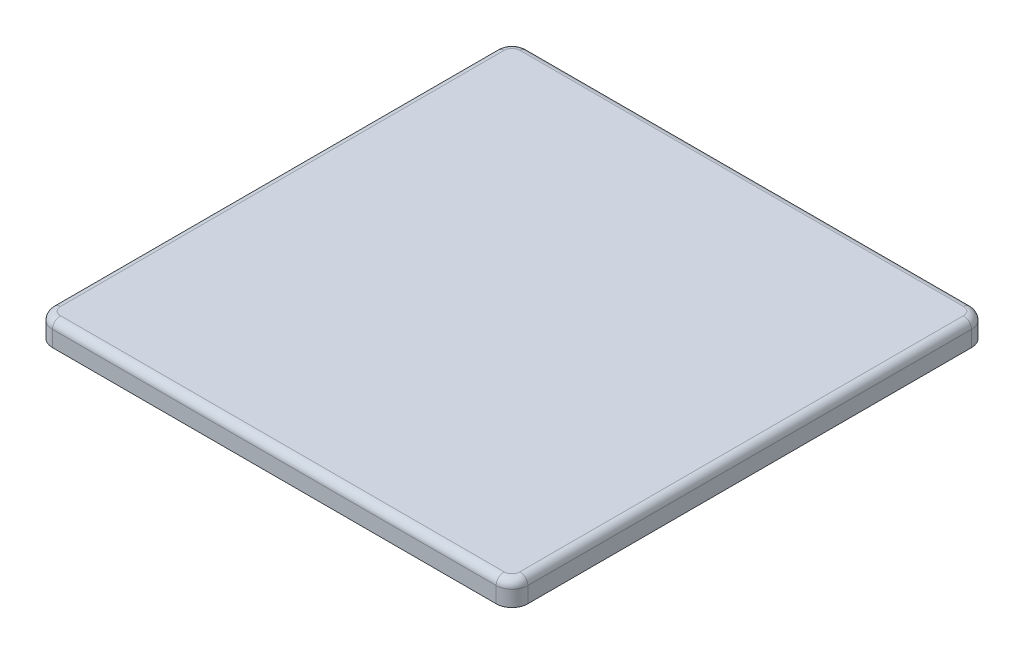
ISO-10303-21;
HEADER;
FILE_DESCRIPTION(('STEP AP214'),'2;1');
FILE_NAME('part.step','',(''),(''),'','','');
FILE_SCHEMA(('AUTOMOTIVE_DESIGN { 1 0 10303 214 1 1 1 1 }'));
ENDSEC;
DATA;
#1=APPLICATION_CONTEXT('core data for automotive mechanical design processes');
#2=APPLICATION_PROTOCOL_DEFINITION('international standard','automotive_design',2000,#1);
#3=PRODUCT_CONTEXT('',#1,'mechanical');
#4=PRODUCT('Part','Part','',(#3));
#5=PRODUCT_RELATED_PRODUCT_CATEGORY('part','',(#4));
#6=PRODUCT_DEFINITION_FORMATION('','',#4);
#7=PRODUCT_DEFINITION_CONTEXT('part definition',#1,'design');
#8=PRODUCT_DEFINITION('design','',#6,#7);
#9=PRODUCT_DEFINITION_SHAPE('','',#8);
#10=(LENGTH_UNIT() NAMED_UNIT(*) SI_UNIT(.MILLI.,.METRE.));
#11=(NAMED_UNIT(*) PLANE_ANGLE_UNIT() SI_UNIT($,.RADIAN.));
#12=(NAMED_UNIT(*) SI_UNIT($,.STERADIAN.) SOLID_ANGLE_UNIT());
#13=UNCERTAINTY_MEASURE_WITH_UNIT(LENGTH_MEASURE(1.E-05),#10,'distance_accuracy_value','');
#14=(GEOMETRIC_REPRESENTATION_CONTEXT(3) GLOBAL_UNCERTAINTY_ASSIGNED_CONTEXT((#13)) GLOBAL_UNIT_ASSIGNED_CONTEXT((#10,
#11,#12)) REPRESENTATION_CONTEXT('',''));
#15=CARTESIAN_POINT('',(0.,0.,0.));
#16=DIRECTION('',(0.,0.,1.));
#17=DIRECTION('',(1.,0.,0.));
#18=AXIS2_PLACEMENT_3D('',#15,#16,#17);
#19=CARTESIAN_POINT('',(-28.,-0.5,28.));
#20=DIRECTION('',(0.,-1.,0.));
#21=DIRECTION('',(0.,0.,-1.));
#22=AXIS2_PLACEMENT_3D('',#19,#20,#21);
#23=PLANE('',#22);
#24=DIRECTION('',(1.,0.,0.));
#25=VECTOR('',#24,1.);
#26=CARTESIAN_POINT('',(-16.65,-0.5,-17.45));
#27=LINE('',#26,#25);
#28=CARTESIAN_POINT('',(-16.65,-0.5,-17.45));
#29=VERTEX_POINT('',#28);
#30=CARTESIAN_POINT('',(-13.35,-0.5,-17.45));
#31=VERTEX_POINT('',#30);
#32=EDGE_CURVE('E354',#29,#31,#27,.T.);
#33=ORIENTED_EDGE('',*,*,#32,.F.);
#34=DIRECTION('',(0.,0.,-1.));
#35=VECTOR('',#34,1.);
#36=CARTESIAN_POINT('',(-16.65,-0.5,-12.55));
#37=LINE('',#36,#35);
#38=CARTESIAN_POINT('',(-16.65,-0.5,-12.55));
#39=VERTEX_POINT('',#38);
#40=EDGE_CURVE('E328',#39,#29,#37,.T.);
#41=ORIENTED_EDGE('',*,*,#40,.F.);
#42=DIRECTION('',(-1.,0.,0.));
#43=VECTOR('',#42,1.);
#44=CARTESIAN_POINT('',(-16.65,-0.5,-12.55));
#45=LINE('',#44,#43);
#46=CARTESIAN_POINT('',(-13.35,-0.5,-12.55));
#47=VERTEX_POINT('',#46);
#48=EDGE_CURVE('E360',#47,#39,#45,.T.);
#49=ORIENTED_EDGE('',*,*,#48,.F.);
#50=DIRECTION('',(0.,0.,1.));
#51=VECTOR('',#50,1.);
#52=CARTESIAN_POINT('',(-13.35,-0.5,-12.55));
#53=LINE('',#52,#51);
#54=EDGE_CURVE('E357',#31,#47,#53,.T.);
#55=ORIENTED_EDGE('',*,*,#54,.F.);
#56=EDGE_LOOP('',(#33,#41,#49,#55));
#57=FACE_BOUND('',#56,.T.);
#58=DIRECTION('',(1.,0.,0.));
#59=VECTOR('',#58,1.);
#60=CARTESIAN_POINT('',(-16.65,-0.5,12.55));
#61=LINE('',#60,#59);
#62=CARTESIAN_POINT('',(-16.65,-0.5,12.55));
#63=VERTEX_POINT('',#62);
#64=CARTESIAN_POINT('',(-13.35,-0.5,12.55));
#65=VERTEX_POINT('',#64);
#66=EDGE_CURVE('E394',#63,#65,#61,.T.);
#67=ORIENTED_EDGE('',*,*,#66,.F.);
#68=DIRECTION('',(0.,0.,-1.));
#69=VECTOR('',#68,1.);
#70=CARTESIAN_POINT('',(-16.65,-0.5,17.45));
#71=LINE('',#70,#69);
#72=CARTESIAN_POINT('',(-16.65,-0.5,17.45));
#73=VERTEX_POINT('',#72);
#74=EDGE_CURVE('E386',#73,#63,#71,.T.);
#75=ORIENTED_EDGE('',*,*,#74,.F.);
#76=DIRECTION('',(-1.,0.,0.));
#77=VECTOR('',#76,1.);
#78=CARTESIAN_POINT('',(-16.65,-0.5,17.45));
#79=LINE('',#78,#77);
#80=CARTESIAN_POINT('',(-13.35,-0.5,17.45));
#81=VERTEX_POINT('',#80);
#82=EDGE_CURVE('E400',#81,#73,#79,.T.);
#83=ORIENTED_EDGE('',*,*,#82,.F.);
#84=DIRECTION('',(0.,0.,1.));
#85=VECTOR('',#84,1.);
#86=CARTESIAN_POINT('',(-13.35,-0.5,17.45));
#87=LINE('',#86,#85);
#88=EDGE_CURVE('E397',#65,#81,#87,.T.);
#89=ORIENTED_EDGE('',*,*,#88,.F.);
#90=EDGE_LOOP('',(#67,#75,#83,#89));
#91=FACE_BOUND('',#90,.T.);
#92=CARTESIAN_POINT('',(-28.,-0.5,28.));
#93=DIRECTION('',(0.,-1.,0.));
#94=DIRECTION('',(0.,0.,-1.));
#95=AXIS2_PLACEMENT_3D('',#92,#93,#94);
#96=CIRCLE('',#95,0.199999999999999);
#97=CARTESIAN_POINT('',(-28.,-0.5,28.2));
#98=VERTEX_POINT('',#97);
#99=CARTESIAN_POINT('',(-28.2,-0.5,28.));
#100=VERTEX_POINT('',#99);
#101=EDGE_CURVE('E412',#98,#100,#96,.T.);
#102=ORIENTED_EDGE('',*,*,#101,.T.);
#103=DIRECTION('',(0.,0.,-1.));
#104=VECTOR('',#103,1.);
#105=CARTESIAN_POINT('',(-28.2,-0.5,28.));
#106=LINE('',#105,#104);
#107=CARTESIAN_POINT('',(-28.2,-0.5,-28.));
#108=VERTEX_POINT('',#107);
#109=EDGE_CURVE('E415',#100,#108,#106,.T.);
#110=ORIENTED_EDGE('',*,*,#109,.T.);
#111=CARTESIAN_POINT('',(-28.,-0.5,-28.));
#112=DIRECTION('',(0.,-1.,0.));
#113=DIRECTION('',(0.,0.,-1.));
#114=AXIS2_PLACEMENT_3D('',#111,#112,#113);
#115=CIRCLE('',#114,0.199999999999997);
#116=CARTESIAN_POINT('',(-28.,-0.5,-28.2));
#117=VERTEX_POINT('',#116);
#118=EDGE_CURVE('E419',#108,#117,#115,.T.);
#119=ORIENTED_EDGE('',*,*,#118,.T.);
#120=DIRECTION('',(1.,0.,0.));
#121=VECTOR('',#120,1.);
#122=CARTESIAN_POINT('',(-28.,-0.5,-28.2));
#123=LINE('',#122,#121);
#124=CARTESIAN_POINT('',(28.,-0.5,-28.2));
#125=VERTEX_POINT('',#124);
#126=EDGE_CURVE('E422',#117,#125,#123,.T.);
#127=ORIENTED_EDGE('',*,*,#126,.T.);
#128=CARTESIAN_POINT('',(28.,-0.5,-28.));
#129=DIRECTION('',(0.,-1.,0.));
#130=DIRECTION('',(0.,0.,-1.));
#131=AXIS2_PLACEMENT_3D('',#128,#129,#130);
#132=CIRCLE('',#131,0.200000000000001);
#133=CARTESIAN_POINT('',(28.2,-0.5,-28.));
#134=VERTEX_POINT('',#133);
#135=EDGE_CURVE('E425',#125,#134,#132,.T.);
#136=ORIENTED_EDGE('',*,*,#135,.T.);
#137=DIRECTION('',(0.,0.,1.));
#138=VECTOR('',#137,1.);
#139=CARTESIAN_POINT('',(28.2,-0.5,28.));
#140=LINE('',#139,#138);
#141=CARTESIAN_POINT('',(28.2,-0.5,28.));
#142=VERTEX_POINT('',#141);
#143=EDGE_CURVE('E428',#134,#142,#140,.T.);
#144=ORIENTED_EDGE('',*,*,#143,.T.);
#145=CARTESIAN_POINT('',(28.,-0.5,28.));
#146=DIRECTION('',(0.,-1.,0.));
#147=DIRECTION('',(0.,0.,-1.));
#148=AXIS2_PLACEMENT_3D('',#145,#146,#147);
#149=CIRCLE('',#148,0.199999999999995);
#150=CARTESIAN_POINT('',(28.,-0.5,28.2));
#151=VERTEX_POINT('',#150);
#152=EDGE_CURVE('E431',#142,#151,#149,.T.);
#153=ORIENTED_EDGE('',*,*,#152,.T.);
#154=DIRECTION('',(-1.,0.,0.));
#155=VECTOR('',#154,1.);
#156=CARTESIAN_POINT('',(-28.,-0.5,28.2));
#157=LINE('',#156,#155);
#158=EDGE_CURVE('E434',#151,#98,#157,.T.);
#159=ORIENTED_EDGE('',*,*,#158,.T.);
#160=EDGE_LOOP('',(#102,#110,#119,#127,#136,#144,#153,#159));
#161=FACE_BOUND('',#160,.T.);
#162=DIRECTION('',(1.,0.,0.));
#163=VECTOR('',#162,1.);
#164=CARTESIAN_POINT('',(13.35,-0.5,12.55));
#165=LINE('',#164,#163);
#166=CARTESIAN_POINT('',(13.35,-0.5,12.55));
#167=VERTEX_POINT('',#166);
#168=CARTESIAN_POINT('',(16.65,-0.5,12.55));
#169=VERTEX_POINT('',#168);
#170=EDGE_CURVE('E374',#167,#169,#165,.T.);
#171=ORIENTED_EDGE('',*,*,#170,.F.);
#172=DIRECTION('',(0.,0.,-1.));
#173=VECTOR('',#172,1.);
#174=CARTESIAN_POINT('',(13.35,-0.5,12.55));
#175=LINE('',#174,#173);
#176=CARTESIAN_POINT('',(13.35,-0.5,17.45));
#177=VERTEX_POINT('',#176);
#178=EDGE_CURVE('E366',#177,#167,#175,.T.);
#179=ORIENTED_EDGE('',*,*,#178,.F.);
#180=DIRECTION('',(-1.,0.,0.));
#181=VECTOR('',#180,1.);
#182=CARTESIAN_POINT('',(13.35,-0.5,17.45));
#183=LINE('',#182,#181);
#184=CARTESIAN_POINT('',(16.65,-0.5,17.45));
#185=VERTEX_POINT('',#184);
#186=EDGE_CURVE('E380',#185,#177,#183,.T.);
#187=ORIENTED_EDGE('',*,*,#186,.F.);
#188=DIRECTION('',(0.,0.,1.));
#189=VECTOR('',#188,1.);
#190=CARTESIAN_POINT('',(16.65,-0.5,12.55));
#191=LINE('',#190,#189);
#192=EDGE_CURVE('E377',#169,#185,#191,.T.);
#193=ORIENTED_EDGE('',*,*,#192,.F.);
#194=EDGE_LOOP('',(#171,#179,#187,#193));
#195=FACE_BOUND('',#194,.T.);
#196=DIRECTION('',(1.,0.,0.));
#197=VECTOR('',#196,1.);
#198=CARTESIAN_POINT('',(13.35,-0.5,-17.45));
#199=LINE('',#198,#197);
#200=CARTESIAN_POINT('',(13.35,-0.5,-17.45));
#201=VERTEX_POINT('',#200);
#202=CARTESIAN_POINT('',(16.65,-0.5,-17.45));
#203=VERTEX_POINT('',#202);
#204=EDGE_CURVE('E322',#201,#203,#199,.T.);
#205=ORIENTED_EDGE('',*,*,#204,.F.);
#206=DIRECTION('',(0.,0.,-1.));
#207=VECTOR('',#206,1.);
#208=CARTESIAN_POINT('',(13.35,-0.5,-12.55));
#209=LINE('',#208,#207);
#210=CARTESIAN_POINT('',(13.35,-0.5,-12.55));
#211=VERTEX_POINT('',#210);
#212=EDGE_CURVE('E332',#211,#201,#209,.T.);
#213=ORIENTED_EDGE('',*,*,#212,.F.);
#214=DIRECTION('',(-1.,0.,0.));
#215=VECTOR('',#214,1.);
#216=CARTESIAN_POINT('',(13.35,-0.5,-12.55));
#217=LINE('',#216,#215);
#218=CARTESIAN_POINT('',(16.65,-0.5,-12.55));
#219=VERTEX_POINT('',#218);
#220=EDGE_CURVE('E344',#219,#211,#217,.T.);
#221=ORIENTED_EDGE('',*,*,#220,.F.);
#222=DIRECTION('',(0.,0.,1.));
#223=VECTOR('',#222,1.);
#224=CARTESIAN_POINT('',(16.65,-0.5,-12.55));
#225=LINE('',#224,#223);
#226=EDGE_CURVE('E342',#203,#219,#225,.T.);
#227=ORIENTED_EDGE('',*,*,#226,.F.);
#228=EDGE_LOOP('',(#205,#213,#221,#227));
#229=FACE_BOUND('',#228,.T.);
#230=ADVANCED_FACE('F35',(#57,#91,#161,#195,#229),#23,.T.);
#231=CARTESIAN_POINT('',(-28.,1.5,-28.));
#232=DIRECTION('',(0.,-1.,0.));
#233=DIRECTION('',(0.,0.,-1.));
#234=AXIS2_PLACEMENT_3D('',#231,#232,#233);
#235=CYLINDRICAL_SURFACE('',#234,2.);
#236=DIRECTION('',(0.,-1.,0.));
#237=VECTOR('',#236,1.);
#238=CARTESIAN_POINT('',(-30.,1.5,-28.));
#239=LINE('',#238,#237);
#240=CARTESIAN_POINT('',(-30.,0.5,-28.));
#241=VERTEX_POINT('',#240);
#242=CARTESIAN_POINT('',(-30.,-1.5,-28.));
#243=VERTEX_POINT('',#242);
#244=EDGE_CURVE('E515',#241,#243,#239,.T.);
#245=ORIENTED_EDGE('',*,*,#244,.F.);
#246=CARTESIAN_POINT('',(-28.,0.5,-28.));
#247=DIRECTION('',(0.,1.,0.));
#248=DIRECTION('',(0.,0.,1.));
#249=AXIS2_PLACEMENT_3D('',#246,#247,#248);
#250=CIRCLE('',#249,2.);
#251=CARTESIAN_POINT('',(-28.,0.5,-30.));
#252=VERTEX_POINT('',#251);
#253=EDGE_CURVE('E539',#241,#252,#250,.F.);
#254=ORIENTED_EDGE('',*,*,#253,.T.);
#255=DIRECTION('',(0.,-1.,0.));
#256=VECTOR('',#255,1.);
#257=CARTESIAN_POINT('',(-28.,1.5,-30.));
#258=LINE('',#257,#256);
#259=CARTESIAN_POINT('',(-28.,-1.5,-30.));
#260=VERTEX_POINT('',#259);
#261=EDGE_CURVE('E501',#252,#260,#258,.T.);
#262=ORIENTED_EDGE('',*,*,#261,.T.);
#263=CARTESIAN_POINT('',(-28.,-1.5,-28.));
#264=DIRECTION('',(0.,1.,0.));
#265=DIRECTION('',(0.,0.,1.));
#266=AXIS2_PLACEMENT_3D('',#263,#264,#265);
#267=CIRCLE('',#266,2.);
#268=EDGE_CURVE('E476',#260,#243,#267,.T.);
#269=ORIENTED_EDGE('',*,*,#268,.T.);
#270=EDGE_LOOP('',(#245,#254,#262,#269));
#271=FACE_BOUND('',#270,.T.);
#272=ADVANCED_FACE('F714',(#271),#235,.T.);
#273=CARTESIAN_POINT('',(-30.,1.5,28.));
#274=DIRECTION('',(1.,0.,0.));
#275=DIRECTION('',(0.,0.,-1.));
#276=AXIS2_PLACEMENT_3D('',#273,#274,#275);
#277=PLANE('',#276);
#278=DIRECTION('',(0.,-1.,0.));
#279=VECTOR('',#278,1.);
#280=CARTESIAN_POINT('',(-30.,1.5,28.));
#281=LINE('',#280,#279);
#282=CARTESIAN_POINT('',(-30.,0.5,28.));
#283=VERTEX_POINT('',#282);
#284=CARTESIAN_POINT('',(-30.,-1.5,28.));
#285=VERTEX_POINT('',#284);
#286=EDGE_CURVE('E513',#283,#285,#281,.T.);
#287=ORIENTED_EDGE('',*,*,#286,.F.);
#288=DIRECTION('',(0.,0.,1.));
#289=VECTOR('',#288,1.);
#290=CARTESIAN_POINT('',(-30.,0.5,-28.));
#291=LINE('',#290,#289);
#292=EDGE_CURVE('E537',#283,#241,#291,.F.);
#293=ORIENTED_EDGE('',*,*,#292,.T.);
#294=ORIENTED_EDGE('',*,*,#244,.T.);
#295=DIRECTION('',(0.,0.,1.));
#296=VECTOR('',#295,1.);
#297=CARTESIAN_POINT('',(-30.,-1.5,28.));
#298=LINE('',#297,#296);
#299=EDGE_CURVE('E479',#243,#285,#298,.T.);
#300=ORIENTED_EDGE('',*,*,#299,.T.);
#301=EDGE_LOOP('',(#287,#293,#294,#300));
#302=FACE_BOUND('',#301,.T.);
#303=ADVANCED_FACE('F720',(#302),#277,.F.);
#304=CARTESIAN_POINT('',(-28.,1.5,28.));
#305=DIRECTION('',(0.,-1.,0.));
#306=DIRECTION('',(0.,0.,-1.));
#307=AXIS2_PLACEMENT_3D('',#304,#305,#306);
#308=CYLINDRICAL_SURFACE('',#307,2.);
#309=DIRECTION('',(0.,-1.,0.));
#310=VECTOR('',#309,1.);
#311=CARTESIAN_POINT('',(-28.,1.5,30.));
#312=LINE('',#311,#310);
#313=CARTESIAN_POINT('',(-28.,0.5,30.));
#314=VERTEX_POINT('',#313);
#315=CARTESIAN_POINT('',(-28.,-1.5,30.));
#316=VERTEX_POINT('',#315);
#317=EDGE_CURVE('E511',#314,#316,#312,.T.);
#318=ORIENTED_EDGE('',*,*,#317,.F.);
#319=CARTESIAN_POINT('',(-28.,0.5,28.));
#320=DIRECTION('',(0.,1.,0.));
#321=DIRECTION('',(0.,0.,1.));
#322=AXIS2_PLACEMENT_3D('',#319,#320,#321);
#323=CIRCLE('',#322,2.);
#324=EDGE_CURVE('E534',#314,#283,#323,.F.);
#325=ORIENTED_EDGE('',*,*,#324,.T.);
#326=ORIENTED_EDGE('',*,*,#286,.T.);
#327=CARTESIAN_POINT('',(-28.,-1.5,28.));
#328=DIRECTION('',(0.,1.,0.));
#329=DIRECTION('',(0.,0.,1.));
#330=AXIS2_PLACEMENT_3D('',#327,#328,#329);
#331=CIRCLE('',#330,2.);
#332=EDGE_CURVE('E483',#285,#316,#331,.T.);
#333=ORIENTED_EDGE('',*,*,#332,.T.);
#334=EDGE_LOOP('',(#318,#325,#326,#333));
#335=FACE_BOUND('',#334,.T.);
#336=ADVANCED_FACE('F790',(#335),#308,.T.);
#337=CARTESIAN_POINT('',(-28.,1.5,30.));
#338=DIRECTION('',(0.,0.,-1.));
#339=DIRECTION('',(-1.,0.,0.));
#340=AXIS2_PLACEMENT_3D('',#337,#338,#339);
#341=PLANE('',#340);
#342=DIRECTION('',(0.,-1.,0.));
#343=VECTOR('',#342,1.);
#344=CARTESIAN_POINT('',(28.,1.5,30.));
#345=LINE('',#344,#343);
#346=CARTESIAN_POINT('',(28.,0.5,30.));
#347=VERTEX_POINT('',#346);
#348=CARTESIAN_POINT('',(28.,-1.5,30.));
#349=VERTEX_POINT('',#348);
#350=EDGE_CURVE('E509',#347,#349,#345,.T.);
#351=ORIENTED_EDGE('',*,*,#350,.F.);
#352=DIRECTION('',(1.,0.,0.));
#353=VECTOR('',#352,1.);
#354=CARTESIAN_POINT('',(-28.,0.5,30.));
#355=LINE('',#354,#353);
#356=EDGE_CURVE('E549',#347,#314,#355,.F.);
#357=ORIENTED_EDGE('',*,*,#356,.T.);
#358=ORIENTED_EDGE('',*,*,#317,.T.);
#359=DIRECTION('',(1.,0.,0.));
#360=VECTOR('',#359,1.);
#361=CARTESIAN_POINT('',(-28.,-1.5,30.));
#362=LINE('',#361,#360);
#363=EDGE_CURVE('E486',#316,#349,#362,.T.);
#364=ORIENTED_EDGE('',*,*,#363,.T.);
#365=EDGE_LOOP('',(#351,#357,#358,#364));
#366=FACE_BOUND('',#365,.T.);
#367=ADVANCED_FACE('F786',(#366),#341,.F.);
#368=CARTESIAN_POINT('',(28.,1.5,28.));
#369=DIRECTION('',(0.,-1.,0.));
#370=DIRECTION('',(0.,0.,-1.));
#371=AXIS2_PLACEMENT_3D('',#368,#369,#370);
#372=CYLINDRICAL_SURFACE('',#371,2.);
#373=DIRECTION('',(0.,-1.,0.));
#374=VECTOR('',#373,1.);
#375=CARTESIAN_POINT('',(30.,1.5,28.));
#376=LINE('',#375,#374);
#377=CARTESIAN_POINT('',(30.,0.5,28.));
#378=VERTEX_POINT('',#377);
#379=CARTESIAN_POINT('',(30.,-1.5,28.));
#380=VERTEX_POINT('',#379);
#381=EDGE_CURVE('E507',#378,#380,#376,.T.);
#382=ORIENTED_EDGE('',*,*,#381,.F.);
#383=CARTESIAN_POINT('',(28.,0.5,28.));
#384=DIRECTION('',(0.,1.,0.));
#385=DIRECTION('',(0.,0.,1.));
#386=AXIS2_PLACEMENT_3D('',#383,#384,#385);
#387=CIRCLE('',#386,2.);
#388=EDGE_CURVE('E547',#378,#347,#387,.F.);
#389=ORIENTED_EDGE('',*,*,#388,.T.);
#390=ORIENTED_EDGE('',*,*,#350,.T.);
#391=CARTESIAN_POINT('',(28.,-1.5,28.));
#392=DIRECTION('',(0.,1.,0.));
#393=DIRECTION('',(0.,0.,1.));
#394=AXIS2_PLACEMENT_3D('',#391,#392,#393);
#395=CIRCLE('',#394,2.);
#396=EDGE_CURVE('E489',#349,#380,#395,.T.);
#397=ORIENTED_EDGE('',*,*,#396,.T.);
#398=EDGE_LOOP('',(#382,#389,#390,#397));
#399=FACE_BOUND('',#398,.T.);
#400=ADVANCED_FACE('F782',(#399),#372,.T.);
#401=CARTESIAN_POINT('',(30.,1.5,28.));
#402=DIRECTION('',(-1.,0.,0.));
#403=DIRECTION('',(0.,0.,1.));
#404=AXIS2_PLACEMENT_3D('',#401,#402,#403);
#405=PLANE('',#404);
#406=DIRECTION('',(0.,-1.,0.));
#407=VECTOR('',#406,1.);
#408=CARTESIAN_POINT('',(30.,1.5,-28.));
#409=LINE('',#408,#407);
#410=CARTESIAN_POINT('',(30.,0.5,-28.));
#411=VERTEX_POINT('',#410);
#412=CARTESIAN_POINT('',(30.,-1.5,-28.));
#413=VERTEX_POINT('',#412);
#414=EDGE_CURVE('E505',#411,#413,#409,.T.);
#415=ORIENTED_EDGE('',*,*,#414,.F.);
#416=DIRECTION('',(0.,0.,-1.));
#417=VECTOR('',#416,1.);
#418=CARTESIAN_POINT('',(30.,0.5,28.));
#419=LINE('',#418,#417);
#420=EDGE_CURVE('E545',#411,#378,#419,.F.);
#421=ORIENTED_EDGE('',*,*,#420,.T.);
#422=ORIENTED_EDGE('',*,*,#381,.T.);
#423=DIRECTION('',(0.,0.,-1.));
#424=VECTOR('',#423,1.);
#425=CARTESIAN_POINT('',(30.,-1.5,28.));
#426=LINE('',#425,#424);
#427=EDGE_CURVE('E492',#380,#413,#426,.T.);
#428=ORIENTED_EDGE('',*,*,#427,.T.);
#429=EDGE_LOOP('',(#415,#421,#422,#428));
#430=FACE_BOUND('',#429,.T.);
#431=ADVANCED_FACE('F778',(#430),#405,.F.);
#432=CARTESIAN_POINT('',(28.,1.5,-28.));
#433=DIRECTION('',(0.,-1.,0.));
#434=DIRECTION('',(0.,0.,-1.));
#435=AXIS2_PLACEMENT_3D('',#432,#433,#434);
#436=CYLINDRICAL_SURFACE('',#435,2.);
#437=DIRECTION('',(0.,-1.,0.));
#438=VECTOR('',#437,1.);
#439=CARTESIAN_POINT('',(28.,1.5,-30.));
#440=LINE('',#439,#438);
#441=CARTESIAN_POINT('',(28.,0.5,-30.));
#442=VERTEX_POINT('',#441);
#443=CARTESIAN_POINT('',(28.,-1.5,-30.));
#444=VERTEX_POINT('',#443);
#445=EDGE_CURVE('E503',#442,#444,#440,.T.);
#446=ORIENTED_EDGE('',*,*,#445,.F.);
#447=CARTESIAN_POINT('',(28.,0.5,-28.));
#448=DIRECTION('',(0.,1.,0.));
#449=DIRECTION('',(0.,0.,1.));
#450=AXIS2_PLACEMENT_3D('',#447,#448,#449);
#451=CIRCLE('',#450,2.);
#452=EDGE_CURVE('E543',#442,#411,#451,.F.);
#453=ORIENTED_EDGE('',*,*,#452,.T.);
#454=ORIENTED_EDGE('',*,*,#414,.T.);
#455=CARTESIAN_POINT('',(28.,-1.5,-28.));
#456=DIRECTION('',(0.,1.,0.));
#457=DIRECTION('',(0.,0.,1.));
#458=AXIS2_PLACEMENT_3D('',#455,#456,#457);
#459=CIRCLE('',#458,2.);
#460=EDGE_CURVE('E495',#413,#444,#459,.T.);
#461=ORIENTED_EDGE('',*,*,#460,.T.);
#462=EDGE_LOOP('',(#446,#453,#454,#461));
#463=FACE_BOUND('',#462,.T.);
#464=ADVANCED_FACE('F774',(#463),#436,.T.);
#465=CARTESIAN_POINT('',(-28.,1.5,-30.));
#466=DIRECTION('',(0.,0.,1.));
#467=DIRECTION('',(1.,0.,0.));
#468=AXIS2_PLACEMENT_3D('',#465,#466,#467);
#469=PLANE('',#468);
#470=ORIENTED_EDGE('',*,*,#261,.F.);
#471=DIRECTION('',(-1.,0.,0.));
#472=VECTOR('',#471,1.);
#473=CARTESIAN_POINT('',(28.,0.5,-30.));
#474=LINE('',#473,#472);
#475=EDGE_CURVE('E541',#252,#442,#474,.F.);
#476=ORIENTED_EDGE('',*,*,#475,.T.);
#477=ORIENTED_EDGE('',*,*,#445,.T.);
#478=DIRECTION('',(-1.,0.,0.));
#479=VECTOR('',#478,1.);
#480=CARTESIAN_POINT('',(-28.,-1.5,-30.));
#481=LINE('',#480,#479);
#482=EDGE_CURVE('E498',#444,#260,#481,.T.);
#483=ORIENTED_EDGE('',*,*,#482,.T.);
#484=EDGE_LOOP('',(#470,#476,#477,#483));
#485=FACE_BOUND('',#484,.T.);
#486=ADVANCED_FACE('F766',(#485),#469,.F.);
#487=CARTESIAN_POINT('',(-28.,1.5,-28.));
#488=DIRECTION('',(0.,1.,0.));
#489=DIRECTION('',(0.,0.,1.));
#490=AXIS2_PLACEMENT_3D('',#487,#488,#489);
#491=PLANE('',#490);
#492=DIRECTION('',(0.,0.,1.));
#493=VECTOR('',#492,1.);
#494=CARTESIAN_POINT('',(-29.,1.5,28.));
#495=LINE('',#494,#493);
#496=CARTESIAN_POINT('',(-29.,1.5,-28.));
#497=VERTEX_POINT('',#496);
#498=CARTESIAN_POINT('',(-29.,1.5,28.));
#499=VERTEX_POINT('',#498);
#500=EDGE_CURVE('E529',#497,#499,#495,.T.);
#501=ORIENTED_EDGE('',*,*,#500,.T.);
#502=CARTESIAN_POINT('',(-28.,1.5,28.));
#503=DIRECTION('',(0.,1.,0.));
#504=DIRECTION('',(0.,0.,1.));
#505=AXIS2_PLACEMENT_3D('',#502,#503,#504);
#506=CIRCLE('',#505,1.);
#507=CARTESIAN_POINT('',(-28.,1.5,29.));
#508=VERTEX_POINT('',#507);
#509=EDGE_CURVE('E531',#499,#508,#506,.T.);
#510=ORIENTED_EDGE('',*,*,#509,.T.);
#511=DIRECTION('',(1.,0.,0.));
#512=VECTOR('',#511,1.);
#513=CARTESIAN_POINT('',(28.,1.5,29.));
#514=LINE('',#513,#512);
#515=CARTESIAN_POINT('',(28.,1.5,29.));
#516=VERTEX_POINT('',#515);
#517=EDGE_CURVE('E517',#508,#516,#514,.T.);
#518=ORIENTED_EDGE('',*,*,#517,.T.);
#519=CARTESIAN_POINT('',(28.,1.5,28.));
#520=DIRECTION('',(0.,1.,0.));
#521=DIRECTION('',(0.,0.,1.));
#522=AXIS2_PLACEMENT_3D('',#519,#520,#521);
#523=CIRCLE('',#522,1.);
#524=CARTESIAN_POINT('',(29.,1.5,28.));
#525=VERTEX_POINT('',#524);
#526=EDGE_CURVE('E519',#516,#525,#523,.T.);
#527=ORIENTED_EDGE('',*,*,#526,.T.);
#528=DIRECTION('',(0.,0.,-1.));
#529=VECTOR('',#528,1.);
#530=CARTESIAN_POINT('',(29.,1.5,-28.));
#531=LINE('',#530,#529);
#532=CARTESIAN_POINT('',(29.,1.5,-28.));
#533=VERTEX_POINT('',#532);
#534=EDGE_CURVE('E521',#525,#533,#531,.T.);
#535=ORIENTED_EDGE('',*,*,#534,.T.);
#536=CARTESIAN_POINT('',(28.,1.5,-28.));
#537=DIRECTION('',(0.,1.,0.));
#538=DIRECTION('',(0.,0.,1.));
#539=AXIS2_PLACEMENT_3D('',#536,#537,#538);
#540=CIRCLE('',#539,1.);
#541=CARTESIAN_POINT('',(28.,1.5,-29.));
#542=VERTEX_POINT('',#541);
#543=EDGE_CURVE('E523',#533,#542,#540,.T.);
#544=ORIENTED_EDGE('',*,*,#543,.T.);
#545=DIRECTION('',(-1.,0.,0.));
#546=VECTOR('',#545,1.);
#547=CARTESIAN_POINT('',(-28.,1.5,-29.));
#548=LINE('',#547,#546);
#549=CARTESIAN_POINT('',(-28.,1.5,-29.));
#550=VERTEX_POINT('',#549);
#551=EDGE_CURVE('E525',#542,#550,#548,.T.);
#552=ORIENTED_EDGE('',*,*,#551,.T.);
#553=CARTESIAN_POINT('',(-28.,1.5,-28.));
#554=DIRECTION('',(0.,1.,0.));
#555=DIRECTION('',(0.,0.,1.));
#556=AXIS2_PLACEMENT_3D('',#553,#554,#555);
#557=CIRCLE('',#556,1.);
#558=EDGE_CURVE('E527',#550,#497,#557,.T.);
#559=ORIENTED_EDGE('',*,*,#558,.T.);
#560=EDGE_LOOP('',(#501,#510,#518,#527,#535,#544,#552,#559));
#561=FACE_BOUND('',#560,.T.);
#562=ADVANCED_FACE('F762',(#561),#491,.T.);
#563=CARTESIAN_POINT('',(-28.,-1.5,-28.));
#564=DIRECTION('',(0.,1.,0.));
#565=DIRECTION('',(0.,0.,1.));
#566=AXIS2_PLACEMENT_3D('',#563,#564,#565);
#567=PLANE('',#566);
#568=DIRECTION('',(0.,0.,-1.));
#569=VECTOR('',#568,1.);
#570=CARTESIAN_POINT('',(-28.2,-1.5,28.));
#571=LINE('',#570,#569);
#572=CARTESIAN_POINT('',(-28.2,-1.5,28.));
#573=VERTEX_POINT('',#572);
#574=CARTESIAN_POINT('',(-28.2,-1.5,-28.));
#575=VERTEX_POINT('',#574);
#576=EDGE_CURVE('E439',#573,#575,#571,.T.);
#577=ORIENTED_EDGE('',*,*,#576,.F.);
#578=CARTESIAN_POINT('',(-28.,-1.5,28.));
#579=DIRECTION('',(0.,-1.,0.));
#580=DIRECTION('',(0.,0.,-1.));
#581=AXIS2_PLACEMENT_3D('',#578,#579,#580);
#582=CIRCLE('',#581,0.199999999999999);
#583=CARTESIAN_POINT('',(-28.,-1.5,28.2));
#584=VERTEX_POINT('',#583);
#585=EDGE_CURVE('E406',#584,#573,#582,.T.);
#586=ORIENTED_EDGE('',*,*,#585,.F.);
#587=DIRECTION('',(-1.,0.,0.));
#588=VECTOR('',#587,1.);
#589=CARTESIAN_POINT('',(-28.,-1.5,28.2));
#590=LINE('',#589,#588);
#591=CARTESIAN_POINT('',(28.,-1.5,28.2));
#592=VERTEX_POINT('',#591);
#593=EDGE_CURVE('E416',#592,#584,#590,.T.);
#594=ORIENTED_EDGE('',*,*,#593,.F.);
#595=CARTESIAN_POINT('',(28.,-1.5,28.));
#596=DIRECTION('',(0.,-1.,0.));
#597=DIRECTION('',(0.,0.,-1.));
#598=AXIS2_PLACEMENT_3D('',#595,#596,#597);
#599=CIRCLE('',#598,0.199999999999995);
#600=CARTESIAN_POINT('',(28.2,-1.5,28.));
#601=VERTEX_POINT('',#600);
#602=EDGE_CURVE('E454',#601,#592,#599,.T.);
#603=ORIENTED_EDGE('',*,*,#602,.F.);
#604=DIRECTION('',(0.,0.,1.));
#605=VECTOR('',#604,1.);
#606=CARTESIAN_POINT('',(28.2,-1.5,28.));
#607=LINE('',#606,#605);
#608=CARTESIAN_POINT('',(28.2,-1.5,-28.));
#609=VERTEX_POINT('',#608);
#610=EDGE_CURVE('E451',#609,#601,#607,.T.);
#611=ORIENTED_EDGE('',*,*,#610,.F.);
#612=CARTESIAN_POINT('',(28.,-1.5,-28.));
#613=DIRECTION('',(0.,-1.,0.));
#614=DIRECTION('',(0.,0.,-1.));
#615=AXIS2_PLACEMENT_3D('',#612,#613,#614);
#616=CIRCLE('',#615,0.200000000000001);
#617=CARTESIAN_POINT('',(28.,-1.5,-28.2));
#618=VERTEX_POINT('',#617);
#619=EDGE_CURVE('E448',#618,#609,#616,.T.);
#620=ORIENTED_EDGE('',*,*,#619,.F.);
#621=DIRECTION('',(1.,0.,0.));
#622=VECTOR('',#621,1.);
#623=CARTESIAN_POINT('',(-28.,-1.5,-28.2));
#624=LINE('',#623,#622);
#625=CARTESIAN_POINT('',(-28.,-1.5,-28.2));
#626=VERTEX_POINT('',#625);
#627=EDGE_CURVE('E445',#626,#618,#624,.T.);
#628=ORIENTED_EDGE('',*,*,#627,.F.);
#629=CARTESIAN_POINT('',(-28.,-1.5,-28.));
#630=DIRECTION('',(0.,-1.,0.));
#631=DIRECTION('',(0.,0.,-1.));
#632=AXIS2_PLACEMENT_3D('',#629,#630,#631);
#633=CIRCLE('',#632,0.199999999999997);
#634=EDGE_CURVE('E442',#575,#626,#633,.T.);
#635=ORIENTED_EDGE('',*,*,#634,.F.);
#636=EDGE_LOOP('',(#577,#586,#594,#603,#611,#620,#628,#635));
#637=FACE_BOUND('',#636,.T.);
#638=ORIENTED_EDGE('',*,*,#268,.F.);
#639=ORIENTED_EDGE('',*,*,#482,.F.);
#640=ORIENTED_EDGE('',*,*,#460,.F.);
#641=ORIENTED_EDGE('',*,*,#427,.F.);
#642=ORIENTED_EDGE('',*,*,#396,.F.);
#643=ORIENTED_EDGE('',*,*,#363,.F.);
#644=ORIENTED_EDGE('',*,*,#332,.F.);
#645=ORIENTED_EDGE('',*,*,#299,.F.);
#646=EDGE_LOOP('',(#638,#639,#640,#641,#642,#643,#644,#645));
#647=FACE_BOUND('',#646,.T.);
#648=ADVANCED_FACE('F765',(#637,#647),#567,.F.);
#649=CARTESIAN_POINT('',(28.,0.5,-28.));
#650=DIRECTION('',(0.,1.,0.));
#651=DIRECTION('',(0.,0.,1.));
#652=AXIS2_PLACEMENT_3D('',#649,#650,#651);
#653=TOROIDAL_SURFACE('',#652,1.,1.);
#654=CARTESIAN_POINT('',(29.,0.5,-28.));
#655=DIRECTION('',(0.,0.,1.));
#656=DIRECTION('',(1.,0.,0.));
#657=AXIS2_PLACEMENT_3D('',#654,#655,#656);
#658=CIRCLE('',#657,1.);
#659=EDGE_CURVE('E567',#411,#533,#658,.T.);
#660=ORIENTED_EDGE('',*,*,#659,.F.);
#661=ORIENTED_EDGE('',*,*,#452,.F.);
#662=CARTESIAN_POINT('',(28.,0.5,-29.));
#663=DIRECTION('',(-1.,0.,0.));
#664=DIRECTION('',(0.,0.,1.));
#665=AXIS2_PLACEMENT_3D('',#662,#663,#664);
#666=CIRCLE('',#665,1.);
#667=EDGE_CURVE('E480',#542,#442,#666,.T.);
#668=ORIENTED_EDGE('',*,*,#667,.F.);
#669=ORIENTED_EDGE('',*,*,#543,.F.);
#670=EDGE_LOOP('',(#660,#661,#668,#669));
#671=FACE_BOUND('',#670,.T.);
#672=ADVANCED_FACE('F770',(#671),#653,.T.);
#673=CARTESIAN_POINT('',(-28.,0.5,-29.));
#674=DIRECTION('',(1.,0.,0.));
#675=DIRECTION('',(0.,0.,-1.));
#676=AXIS2_PLACEMENT_3D('',#673,#674,#675);
#677=CYLINDRICAL_SURFACE('',#676,1.);
#678=ORIENTED_EDGE('',*,*,#667,.T.);
#679=ORIENTED_EDGE('',*,*,#475,.F.);
#680=CARTESIAN_POINT('',(-28.,0.5,-29.));
#681=DIRECTION('',(-1.,0.,0.));
#682=DIRECTION('',(0.,0.,1.));
#683=AXIS2_PLACEMENT_3D('',#680,#681,#682);
#684=CIRCLE('',#683,1.);
#685=EDGE_CURVE('E564',#550,#252,#684,.T.);
#686=ORIENTED_EDGE('',*,*,#685,.F.);
#687=ORIENTED_EDGE('',*,*,#551,.F.);
#688=EDGE_LOOP('',(#678,#679,#686,#687));
#689=FACE_BOUND('',#688,.T.);
#690=ADVANCED_FACE('F820',(#689),#677,.T.);
#691=CARTESIAN_POINT('',(29.,0.5,-28.));
#692=DIRECTION('',(0.,0.,1.));
#693=DIRECTION('',(1.,0.,0.));
#694=AXIS2_PLACEMENT_3D('',#691,#692,#693);
#695=CYLINDRICAL_SURFACE('',#694,1.);
#696=ORIENTED_EDGE('',*,*,#659,.T.);
#697=ORIENTED_EDGE('',*,*,#534,.F.);
#698=CARTESIAN_POINT('',(29.,0.5,28.));
#699=DIRECTION('',(0.,0.,1.));
#700=DIRECTION('',(1.,0.,0.));
#701=AXIS2_PLACEMENT_3D('',#698,#699,#700);
#702=CIRCLE('',#701,1.);
#703=EDGE_CURVE('E561',#378,#525,#702,.T.);
#704=ORIENTED_EDGE('',*,*,#703,.F.);
#705=ORIENTED_EDGE('',*,*,#420,.F.);
#706=EDGE_LOOP('',(#696,#697,#704,#705));
#707=FACE_BOUND('',#706,.T.);
#708=ADVANCED_FACE('F816',(#707),#695,.T.);
#709=CARTESIAN_POINT('',(-28.,0.5,-28.));
#710=DIRECTION('',(0.,1.,0.));
#711=DIRECTION('',(0.,0.,1.));
#712=AXIS2_PLACEMENT_3D('',#709,#710,#711);
#713=TOROIDAL_SURFACE('',#712,1.,1.);
#714=ORIENTED_EDGE('',*,*,#685,.T.);
#715=ORIENTED_EDGE('',*,*,#253,.F.);
#716=CARTESIAN_POINT('',(-29.,0.5,-28.));
#717=DIRECTION('',(0.,0.,1.));
#718=DIRECTION('',(1.,0.,0.));
#719=AXIS2_PLACEMENT_3D('',#716,#717,#718);
#720=CIRCLE('',#719,1.);
#721=EDGE_CURVE('E558',#497,#241,#720,.T.);
#722=ORIENTED_EDGE('',*,*,#721,.F.);
#723=ORIENTED_EDGE('',*,*,#558,.F.);
#724=EDGE_LOOP('',(#714,#715,#722,#723));
#725=FACE_BOUND('',#724,.T.);
#726=ADVANCED_FACE('F812',(#725),#713,.T.);
#727=CARTESIAN_POINT('',(28.,0.5,28.));
#728=DIRECTION('',(0.,1.,0.));
#729=DIRECTION('',(0.,0.,1.));
#730=AXIS2_PLACEMENT_3D('',#727,#728,#729);
#731=TOROIDAL_SURFACE('',#730,1.,1.);
#732=ORIENTED_EDGE('',*,*,#703,.T.);
#733=ORIENTED_EDGE('',*,*,#526,.F.);
#734=CARTESIAN_POINT('',(28.,0.5,29.));
#735=DIRECTION('',(-1.,0.,0.));
#736=DIRECTION('',(0.,0.,1.));
#737=AXIS2_PLACEMENT_3D('',#734,#735,#736);
#738=CIRCLE('',#737,1.);
#739=EDGE_CURVE('E555',#347,#516,#738,.T.);
#740=ORIENTED_EDGE('',*,*,#739,.F.);
#741=ORIENTED_EDGE('',*,*,#388,.F.);
#742=EDGE_LOOP('',(#732,#733,#740,#741));
#743=FACE_BOUND('',#742,.T.);
#744=ADVANCED_FACE('F808',(#743),#731,.T.);
#745=CARTESIAN_POINT('',(-29.,0.5,-28.));
#746=DIRECTION('',(0.,0.,-1.));
#747=DIRECTION('',(-1.,0.,0.));
#748=AXIS2_PLACEMENT_3D('',#745,#746,#747);
#749=CYLINDRICAL_SURFACE('',#748,1.);
#750=ORIENTED_EDGE('',*,*,#721,.T.);
#751=ORIENTED_EDGE('',*,*,#292,.F.);
#752=CARTESIAN_POINT('',(-29.,0.5,28.));
#753=DIRECTION('',(0.,0.,1.));
#754=DIRECTION('',(1.,0.,0.));
#755=AXIS2_PLACEMENT_3D('',#752,#753,#754);
#756=CIRCLE('',#755,1.);
#757=EDGE_CURVE('E553',#499,#283,#756,.T.);
#758=ORIENTED_EDGE('',*,*,#757,.F.);
#759=ORIENTED_EDGE('',*,*,#500,.F.);
#760=EDGE_LOOP('',(#750,#751,#758,#759));
#761=FACE_BOUND('',#760,.T.);
#762=ADVANCED_FACE('F804',(#761),#749,.T.);
#763=CARTESIAN_POINT('',(-28.,0.5,29.));
#764=DIRECTION('',(-1.,0.,0.));
#765=DIRECTION('',(0.,0.,1.));
#766=AXIS2_PLACEMENT_3D('',#763,#764,#765);
#767=CYLINDRICAL_SURFACE('',#766,1.);
#768=ORIENTED_EDGE('',*,*,#739,.T.);
#769=ORIENTED_EDGE('',*,*,#517,.F.);
#770=CARTESIAN_POINT('',(-28.,0.5,29.));
#771=DIRECTION('',(-1.,0.,0.));
#772=DIRECTION('',(0.,0.,1.));
#773=AXIS2_PLACEMENT_3D('',#770,#771,#772);
#774=CIRCLE('',#773,1.);
#775=EDGE_CURVE('E461',#314,#508,#774,.T.);
#776=ORIENTED_EDGE('',*,*,#775,.F.);
#777=ORIENTED_EDGE('',*,*,#356,.F.);
#778=EDGE_LOOP('',(#768,#769,#776,#777));
#779=FACE_BOUND('',#778,.T.);
#780=ADVANCED_FACE('F800',(#779),#767,.T.);
#781=CARTESIAN_POINT('',(-28.,0.5,28.));
#782=DIRECTION('',(0.,1.,0.));
#783=DIRECTION('',(0.,0.,1.));
#784=AXIS2_PLACEMENT_3D('',#781,#782,#783);
#785=TOROIDAL_SURFACE('',#784,1.,1.);
#786=ORIENTED_EDGE('',*,*,#757,.T.);
#787=ORIENTED_EDGE('',*,*,#324,.F.);
#788=ORIENTED_EDGE('',*,*,#775,.T.);
#789=ORIENTED_EDGE('',*,*,#509,.F.);
#790=EDGE_LOOP('',(#786,#787,#788,#789));
#791=FACE_BOUND('',#790,.T.);
#792=ADVANCED_FACE('F760',(#791),#785,.T.);
#793=CARTESIAN_POINT('',(-28.,-0.5,28.));
#794=DIRECTION('',(0.,-1.,0.));
#795=DIRECTION('',(0.,0.,-1.));
#796=AXIS2_PLACEMENT_3D('',#793,#794,#795);
#797=CYLINDRICAL_SURFACE('',#796,0.199999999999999);
#798=ORIENTED_EDGE('',*,*,#585,.T.);
#799=DIRECTION('',(0.,-1.,0.));
#800=VECTOR('',#799,1.);
#801=CARTESIAN_POINT('',(-28.2,-0.5,28.));
#802=LINE('',#801,#800);
#803=EDGE_CURVE('E437',#100,#573,#802,.T.);
#804=ORIENTED_EDGE('',*,*,#803,.F.);
#805=ORIENTED_EDGE('',*,*,#101,.F.);
#806=DIRECTION('',(0.,-1.,0.));
#807=VECTOR('',#806,1.);
#808=CARTESIAN_POINT('',(-28.,-0.5,28.2));
#809=LINE('',#808,#807);
#810=EDGE_CURVE('E459',#98,#584,#809,.T.);
#811=ORIENTED_EDGE('',*,*,#810,.T.);
#812=EDGE_LOOP('',(#798,#804,#805,#811));
#813=FACE_BOUND('',#812,.T.);
#814=ADVANCED_FACE('F733',(#813),#797,.F.);
#815=CARTESIAN_POINT('',(-28.,-0.5,28.2));
#816=DIRECTION('',(0.,0.,1.));
#817=DIRECTION('',(1.,0.,0.));
#818=AXIS2_PLACEMENT_3D('',#815,#816,#817);
#819=PLANE('',#818);
#820=ORIENTED_EDGE('',*,*,#593,.T.);
#821=ORIENTED_EDGE('',*,*,#810,.F.);
#822=ORIENTED_EDGE('',*,*,#158,.F.);
#823=DIRECTION('',(0.,-1.,0.));
#824=VECTOR('',#823,1.);
#825=CARTESIAN_POINT('',(28.,-0.5,28.2));
#826=LINE('',#825,#824);
#827=EDGE_CURVE('E462',#151,#592,#826,.T.);
#828=ORIENTED_EDGE('',*,*,#827,.T.);
#829=EDGE_LOOP('',(#820,#821,#822,#828));
#830=FACE_BOUND('',#829,.T.);
#831=ADVANCED_FACE('F729',(#830),#819,.F.);
#832=CARTESIAN_POINT('',(28.,-0.5,28.));
#833=DIRECTION('',(0.,-1.,0.));
#834=DIRECTION('',(0.,0.,-1.));
#835=AXIS2_PLACEMENT_3D('',#832,#833,#834);
#836=CYLINDRICAL_SURFACE('',#835,0.199999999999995);
#837=ORIENTED_EDGE('',*,*,#602,.T.);
#838=ORIENTED_EDGE('',*,*,#827,.F.);
#839=ORIENTED_EDGE('',*,*,#152,.F.);
#840=DIRECTION('',(0.,-1.,0.));
#841=VECTOR('',#840,1.);
#842=CARTESIAN_POINT('',(28.2,-0.5,28.));
#843=LINE('',#842,#841);
#844=EDGE_CURVE('E464',#142,#601,#843,.T.);
#845=ORIENTED_EDGE('',*,*,#844,.T.);
#846=EDGE_LOOP('',(#837,#838,#839,#845));
#847=FACE_BOUND('',#846,.T.);
#848=ADVANCED_FACE('F732',(#847),#836,.F.);
#849=CARTESIAN_POINT('',(28.2,-0.5,28.));
#850=DIRECTION('',(1.,0.,0.));
#851=DIRECTION('',(0.,0.,-1.));
#852=AXIS2_PLACEMENT_3D('',#849,#850,#851);
#853=PLANE('',#852);
#854=ORIENTED_EDGE('',*,*,#610,.T.);
#855=ORIENTED_EDGE('',*,*,#844,.F.);
#856=ORIENTED_EDGE('',*,*,#143,.F.);
#857=DIRECTION('',(0.,-1.,0.));
#858=VECTOR('',#857,1.);
#859=CARTESIAN_POINT('',(28.2,-0.5,-28.));
#860=LINE('',#859,#858);
#861=EDGE_CURVE('E466',#134,#609,#860,.T.);
#862=ORIENTED_EDGE('',*,*,#861,.T.);
#863=EDGE_LOOP('',(#854,#855,#856,#862));
#864=FACE_BOUND('',#863,.T.);
#865=ADVANCED_FACE('F737',(#864),#853,.F.);
#866=CARTESIAN_POINT('',(28.,-0.5,-28.));
#867=DIRECTION('',(0.,-1.,0.));
#868=DIRECTION('',(0.,0.,-1.));
#869=AXIS2_PLACEMENT_3D('',#866,#867,#868);
#870=CYLINDRICAL_SURFACE('',#869,0.200000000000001);
#871=ORIENTED_EDGE('',*,*,#619,.T.);
#872=ORIENTED_EDGE('',*,*,#861,.F.);
#873=ORIENTED_EDGE('',*,*,#135,.F.);
#874=DIRECTION('',(0.,-1.,0.));
#875=VECTOR('',#874,1.);
#876=CARTESIAN_POINT('',(28.,-0.5,-28.2));
#877=LINE('',#876,#875);
#878=EDGE_CURVE('E468',#125,#618,#877,.T.);
#879=ORIENTED_EDGE('',*,*,#878,.T.);
#880=EDGE_LOOP('',(#871,#872,#873,#879));
#881=FACE_BOUND('',#880,.T.);
#882=ADVANCED_FACE('F741',(#881),#870,.F.);
#883=CARTESIAN_POINT('',(-28.,-0.5,-28.2));
#884=DIRECTION('',(0.,0.,-1.));
#885=DIRECTION('',(-1.,0.,0.));
#886=AXIS2_PLACEMENT_3D('',#883,#884,#885);
#887=PLANE('',#886);
#888=ORIENTED_EDGE('',*,*,#627,.T.);
#889=ORIENTED_EDGE('',*,*,#878,.F.);
#890=ORIENTED_EDGE('',*,*,#126,.F.);
#891=DIRECTION('',(0.,-1.,0.));
#892=VECTOR('',#891,1.);
#893=CARTESIAN_POINT('',(-28.,-0.5,-28.2));
#894=LINE('',#893,#892);
#895=EDGE_CURVE('E470',#117,#626,#894,.T.);
#896=ORIENTED_EDGE('',*,*,#895,.T.);
#897=EDGE_LOOP('',(#888,#889,#890,#896));
#898=FACE_BOUND('',#897,.T.);
#899=ADVANCED_FACE('F745',(#898),#887,.F.);
#900=CARTESIAN_POINT('',(-28.,-0.5,-28.));
#901=DIRECTION('',(0.,-1.,0.));
#902=DIRECTION('',(0.,0.,-1.));
#903=AXIS2_PLACEMENT_3D('',#900,#901,#902);
#904=CYLINDRICAL_SURFACE('',#903,0.199999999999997);
#905=ORIENTED_EDGE('',*,*,#634,.T.);
#906=ORIENTED_EDGE('',*,*,#895,.F.);
#907=ORIENTED_EDGE('',*,*,#118,.F.);
#908=DIRECTION('',(0.,-1.,0.));
#909=VECTOR('',#908,1.);
#910=CARTESIAN_POINT('',(-28.2,-0.5,-28.));
#911=LINE('',#910,#909);
#912=EDGE_CURVE('E472',#108,#575,#911,.T.);
#913=ORIENTED_EDGE('',*,*,#912,.T.);
#914=EDGE_LOOP('',(#905,#906,#907,#913));
#915=FACE_BOUND('',#914,.T.);
#916=ADVANCED_FACE('F749',(#915),#904,.F.);
#917=CARTESIAN_POINT('',(-28.2,-0.5,28.));
#918=DIRECTION('',(-1.,0.,0.));
#919=DIRECTION('',(0.,0.,1.));
#920=AXIS2_PLACEMENT_3D('',#917,#918,#919);
#921=PLANE('',#920);
#922=ORIENTED_EDGE('',*,*,#576,.T.);
#923=ORIENTED_EDGE('',*,*,#912,.F.);
#924=ORIENTED_EDGE('',*,*,#109,.F.);
#925=ORIENTED_EDGE('',*,*,#803,.T.);
#926=EDGE_LOOP('',(#922,#923,#924,#925));
#927=FACE_BOUND('',#926,.T.);
#928=ADVANCED_FACE('F753',(#927),#921,.F.);
#929=CARTESIAN_POINT('',(-16.65,-0.5,17.45));
#930=DIRECTION('',(-0.999945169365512,-0.0104717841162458,0.));
#931=DIRECTION('',(0.0104717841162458,-0.999945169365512,0.));
#932=AXIS2_PLACEMENT_3D('',#929,#930,#931);
#933=PLANE('',#932);
#934=DIRECTION('',(-0.0104712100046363,0.999890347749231,-0.0104712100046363));
#935=VECTOR('',#934,1.);
#936=CARTESIAN_POINT('',(-16.65,-0.5,12.55));
#937=LINE('',#936,#935);
#938=CARTESIAN_POINT('',(-16.574511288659,-7.70837742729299,12.625488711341));
#939=VERTEX_POINT('',#938);
#940=EDGE_CURVE('E404',#939,#63,#937,.T.);
#941=ORIENTED_EDGE('',*,*,#940,.F.);
#942=DIRECTION('',(0.,0.,-1.));
#943=VECTOR('',#942,1.);
#944=CARTESIAN_POINT('',(-16.574511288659,-7.708377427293,17.3662211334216));
#945=LINE('',#944,#943);
#946=CARTESIAN_POINT('',(-16.574511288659,-7.70837742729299,17.374511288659));
#947=VERTEX_POINT('',#946);
#948=EDGE_CURVE('E11',#939,#947,#945,.F.);
#949=ORIENTED_EDGE('',*,*,#948,.T.);
#950=DIRECTION('',(-0.0104712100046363,0.999890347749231,0.0104712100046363));
#951=VECTOR('',#950,1.);
#952=CARTESIAN_POINT('',(-16.65,-0.5,17.45));
#953=LINE('',#952,#951);
#954=EDGE_CURVE('E403',#947,#73,#953,.T.);
#955=ORIENTED_EDGE('',*,*,#954,.T.);
#956=ORIENTED_EDGE('',*,*,#74,.T.);
#957=EDGE_LOOP('',(#941,#949,#955,#956));
#958=FACE_BOUND('',#957,.T.);
#959=ADVANCED_FACE('F688',(#958),#933,.T.);
#960=CARTESIAN_POINT('',(-16.65,-0.5,12.55));
#961=DIRECTION('',(0.,-0.0104717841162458,-0.999945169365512));
#962=DIRECTION('',(0.,0.999945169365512,-0.0104717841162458));
#963=AXIS2_PLACEMENT_3D('',#960,#961,#962);
#964=PLANE('',#963);
#965=DIRECTION('',(0.0104712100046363,0.999890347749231,-0.0104712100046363));
#966=VECTOR('',#965,1.);
#967=CARTESIAN_POINT('',(-13.3505372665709,-0.551303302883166,12.5505372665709));
#968=LINE('',#967,#966);
#969=CARTESIAN_POINT('',(-13.425488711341,-7.708377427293,12.625488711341));
#970=VERTEX_POINT('',#969);
#971=EDGE_CURVE('E407',#970,#65,#968,.T.);
#972=ORIENTED_EDGE('',*,*,#971,.F.);
#973=DIRECTION('',(1.,0.,0.));
#974=VECTOR('',#973,1.);
#975=CARTESIAN_POINT('',(-16.5662211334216,-7.708377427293,12.625488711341));
#976=LINE('',#975,#974);
#977=EDGE_CURVE('E44',#970,#939,#976,.F.);
#978=ORIENTED_EDGE('',*,*,#977,.T.);
#979=ORIENTED_EDGE('',*,*,#940,.T.);
#980=ORIENTED_EDGE('',*,*,#66,.T.);
#981=EDGE_LOOP('',(#972,#978,#979,#980));
#982=FACE_BOUND('',#981,.T.);
#983=ADVANCED_FACE('F727',(#982),#964,.T.);
#984=CARTESIAN_POINT('',(-13.35,-0.5,17.45));
#985=DIRECTION('',(0.999945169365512,-0.0104717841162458,0.));
#986=DIRECTION('',(0.0104717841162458,0.999945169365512,0.));
#987=AXIS2_PLACEMENT_3D('',#984,#985,#986);
#988=PLANE('',#987);
#989=DIRECTION('',(0.0104712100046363,0.999890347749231,0.0104712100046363));
#990=VECTOR('',#989,1.);
#991=CARTESIAN_POINT('',(-13.3503618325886,-0.53455120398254,17.4496381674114));
#992=LINE('',#991,#990);
#993=CARTESIAN_POINT('',(-13.425488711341,-7.70837742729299,17.374511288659));
#994=VERTEX_POINT('',#993);
#995=EDGE_CURVE('E409',#994,#81,#992,.T.);
#996=ORIENTED_EDGE('',*,*,#995,.F.);
#997=DIRECTION('',(0.,0.,1.));
#998=VECTOR('',#997,1.);
#999=CARTESIAN_POINT('',(-13.425488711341,-7.708377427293,12.6337788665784));
#1000=LINE('',#999,#998);
#1001=EDGE_CURVE('E59',#994,#970,#1000,.F.);
#1002=ORIENTED_EDGE('',*,*,#1001,.T.);
#1003=ORIENTED_EDGE('',*,*,#971,.T.);
#1004=ORIENTED_EDGE('',*,*,#88,.T.);
#1005=EDGE_LOOP('',(#996,#1002,#1003,#1004));
#1006=FACE_BOUND('',#1005,.T.);
#1007=ADVANCED_FACE('F709',(#1006),#988,.T.);
#1008=CARTESIAN_POINT('',(-16.65,-0.5,17.45));
#1009=DIRECTION('',(0.,-0.0104717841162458,0.999945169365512));
#1010=DIRECTION('',(0.,-0.999945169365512,-0.0104717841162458));
#1011=AXIS2_PLACEMENT_3D('',#1008,#1009,#1010);
#1012=PLANE('',#1011);
#1013=ORIENTED_EDGE('',*,*,#954,.F.);
#1014=DIRECTION('',(-1.,0.,0.));
#1015=VECTOR('',#1014,1.);
#1016=CARTESIAN_POINT('',(-13.4337788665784,-7.708377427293,17.374511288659));
#1017=LINE('',#1016,#1015);
#1018=EDGE_CURVE('E633',#947,#994,#1017,.F.);
#1019=ORIENTED_EDGE('',*,*,#1018,.T.);
#1020=ORIENTED_EDGE('',*,*,#995,.T.);
#1021=ORIENTED_EDGE('',*,*,#82,.T.);
#1022=EDGE_LOOP('',(#1013,#1019,#1020,#1021));
#1023=FACE_BOUND('',#1022,.T.);
#1024=ADVANCED_FACE('F691',(#1023),#1012,.T.);
#1025=CARTESIAN_POINT('',(-16.65,-8.5,12.55));
#1026=DIRECTION('',(0.,-1.,0.));
#1027=DIRECTION('',(0.,0.,-1.));
#1028=AXIS2_PLACEMENT_3D('',#1025,#1026,#1027);
#1029=PLANE('',#1028);
#1030=DIRECTION('',(0.,0.,-1.));
#1031=VECTOR('',#1030,1.);
#1032=CARTESIAN_POINT('',(-14.2254448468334,-8.5,17.3662211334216));
#1033=LINE('',#1032,#1031);
#1034=CARTESIAN_POINT('',(-14.2254448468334,-8.5,13.4254448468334));
#1035=VERTEX_POINT('',#1034);
#1036=CARTESIAN_POINT('',(-14.2254448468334,-8.5,16.5745551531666));
#1037=VERTEX_POINT('',#1036);
#1038=EDGE_CURVE('E628',#1035,#1037,#1033,.F.);
#1039=ORIENTED_EDGE('',*,*,#1038,.T.);
#1040=DIRECTION('',(1.,0.,0.));
#1041=VECTOR('',#1040,1.);
#1042=CARTESIAN_POINT('',(-16.5662211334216,-8.5,16.5745551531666));
#1043=LINE('',#1042,#1041);
#1044=CARTESIAN_POINT('',(-15.7745551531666,-8.5,16.5745551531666));
#1045=VERTEX_POINT('',#1044);
#1046=EDGE_CURVE('E630',#1037,#1045,#1043,.F.);
#1047=ORIENTED_EDGE('',*,*,#1046,.T.);
#1048=DIRECTION('',(0.,0.,1.));
#1049=VECTOR('',#1048,1.);
#1050=CARTESIAN_POINT('',(-15.7745551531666,-8.5,12.6337788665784));
#1051=LINE('',#1050,#1049);
#1052=CARTESIAN_POINT('',(-15.7745551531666,-8.5,13.4254448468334));
#1053=VERTEX_POINT('',#1052);
#1054=EDGE_CURVE('E624',#1045,#1053,#1051,.F.);
#1055=ORIENTED_EDGE('',*,*,#1054,.T.);
#1056=DIRECTION('',(-1.,0.,0.));
#1057=VECTOR('',#1056,1.);
#1058=CARTESIAN_POINT('',(-13.4337788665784,-8.5,13.4254448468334));
#1059=LINE('',#1058,#1057);
#1060=EDGE_CURVE('E626',#1053,#1035,#1059,.F.);
#1061=ORIENTED_EDGE('',*,*,#1060,.T.);
#1062=EDGE_LOOP('',(#1039,#1047,#1055,#1061));
#1063=FACE_BOUND('',#1062,.T.);
#1064=ADVANCED_FACE('F698',(#1063),#1029,.T.);
#1065=CARTESIAN_POINT('',(13.35,-0.5,12.55));
#1066=DIRECTION('',(-0.999945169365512,-0.0104717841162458,0.));
#1067=DIRECTION('',(0.0104717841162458,-0.999945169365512,0.));
#1068=AXIS2_PLACEMENT_3D('',#1065,#1066,#1067);
#1069=PLANE('',#1068);
#1070=DIRECTION('',(-0.0104712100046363,0.999890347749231,-0.0104712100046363));
#1071=VECTOR('',#1070,1.);
#1072=CARTESIAN_POINT('',(13.35,-0.5,12.55));
#1073=LINE('',#1072,#1071);
#1074=CARTESIAN_POINT('',(13.425488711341,-7.708377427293,12.625488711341));
#1075=VERTEX_POINT('',#1074);
#1076=EDGE_CURVE('E384',#1075,#167,#1073,.T.);
#1077=ORIENTED_EDGE('',*,*,#1076,.F.);
#1078=DIRECTION('',(0.,0.,-1.));
#1079=VECTOR('',#1078,1.);
#1080=CARTESIAN_POINT('',(13.425488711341,-7.708377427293,12.55));
#1081=LINE('',#1080,#1079);
#1082=CARTESIAN_POINT('',(13.425488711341,-7.708377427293,17.374511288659));
#1083=VERTEX_POINT('',#1082);
#1084=EDGE_CURVE('E622',#1075,#1083,#1081,.F.);
#1085=ORIENTED_EDGE('',*,*,#1084,.T.);
#1086=DIRECTION('',(-0.0104712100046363,0.999890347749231,0.0104712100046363));
#1087=VECTOR('',#1086,1.);
#1088=CARTESIAN_POINT('',(13.3505372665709,-0.551303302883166,17.4494627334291));
#1089=LINE('',#1088,#1087);
#1090=EDGE_CURVE('E383',#1083,#177,#1089,.T.);
#1091=ORIENTED_EDGE('',*,*,#1090,.T.);
#1092=ORIENTED_EDGE('',*,*,#178,.T.);
#1093=EDGE_LOOP('',(#1077,#1085,#1091,#1092));
#1094=FACE_BOUND('',#1093,.T.);
#1095=ADVANCED_FACE('F700',(#1094),#1069,.T.);
#1096=CARTESIAN_POINT('',(13.35,-0.5,12.55));
#1097=DIRECTION('',(0.,-0.0104717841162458,-0.999945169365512));
#1098=DIRECTION('',(0.,0.999945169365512,-0.0104717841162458));
#1099=AXIS2_PLACEMENT_3D('',#1096,#1097,#1098);
#1100=PLANE('',#1099);
#1101=DIRECTION('',(0.0104712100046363,0.999890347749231,-0.0104712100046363));
#1102=VECTOR('',#1101,1.);
#1103=CARTESIAN_POINT('',(16.65,-0.5,12.55));
#1104=LINE('',#1103,#1102);
#1105=CARTESIAN_POINT('',(16.574511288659,-7.70837742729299,12.625488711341));
#1106=VERTEX_POINT('',#1105);
#1107=EDGE_CURVE('E387',#1106,#169,#1104,.T.);
#1108=ORIENTED_EDGE('',*,*,#1107,.F.);
#1109=DIRECTION('',(1.,0.,0.));
#1110=VECTOR('',#1109,1.);
#1111=CARTESIAN_POINT('',(13.35,-7.708377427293,12.625488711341));
#1112=LINE('',#1111,#1110);
#1113=EDGE_CURVE('E620',#1106,#1075,#1112,.F.);
#1114=ORIENTED_EDGE('',*,*,#1113,.T.);
#1115=ORIENTED_EDGE('',*,*,#1076,.T.);
#1116=ORIENTED_EDGE('',*,*,#170,.T.);
#1117=EDGE_LOOP('',(#1108,#1114,#1115,#1116));
#1118=FACE_BOUND('',#1117,.T.);
#1119=ADVANCED_FACE('F706',(#1118),#1100,.T.);
#1120=CARTESIAN_POINT('',(16.65,-0.5,12.55));
#1121=DIRECTION('',(0.999945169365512,-0.0104717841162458,0.));
#1122=DIRECTION('',(0.0104717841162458,0.999945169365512,0.));
#1123=AXIS2_PLACEMENT_3D('',#1120,#1121,#1122);
#1124=PLANE('',#1123);
#1125=DIRECTION('',(0.0104712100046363,0.999890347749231,0.0104712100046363));
#1126=VECTOR('',#1125,1.);
#1127=CARTESIAN_POINT('',(16.6496381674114,-0.53455120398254,17.4496381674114));
#1128=LINE('',#1127,#1126);
#1129=CARTESIAN_POINT('',(16.574511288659,-7.70837742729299,17.374511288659));
#1130=VERTEX_POINT('',#1129);
#1131=EDGE_CURVE('E389',#1130,#185,#1128,.T.);
#1132=ORIENTED_EDGE('',*,*,#1131,.F.);
#1133=DIRECTION('',(0.,0.,1.));
#1134=VECTOR('',#1133,1.);
#1135=CARTESIAN_POINT('',(16.574511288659,-7.708377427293,12.55));
#1136=LINE('',#1135,#1134);
#1137=EDGE_CURVE('E618',#1130,#1106,#1136,.F.);
#1138=ORIENTED_EDGE('',*,*,#1137,.T.);
#1139=ORIENTED_EDGE('',*,*,#1107,.T.);
#1140=ORIENTED_EDGE('',*,*,#192,.T.);
#1141=EDGE_LOOP('',(#1132,#1138,#1139,#1140));
#1142=FACE_BOUND('',#1141,.T.);
#1143=ADVANCED_FACE('F1024',(#1142),#1124,.T.);
#1144=CARTESIAN_POINT('',(13.35,-0.5,17.45));
#1145=DIRECTION('',(0.,-0.0104717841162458,0.999945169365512));
#1146=DIRECTION('',(0.,-0.999945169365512,-0.0104717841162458));
#1147=AXIS2_PLACEMENT_3D('',#1144,#1145,#1146);
#1148=PLANE('',#1147);
#1149=ORIENTED_EDGE('',*,*,#1090,.F.);
#1150=DIRECTION('',(-1.,0.,0.));
#1151=VECTOR('',#1150,1.);
#1152=CARTESIAN_POINT('',(13.35,-7.708377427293,17.374511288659));
#1153=LINE('',#1152,#1151);
#1154=EDGE_CURVE('E615',#1083,#1130,#1153,.F.);
#1155=ORIENTED_EDGE('',*,*,#1154,.T.);
#1156=ORIENTED_EDGE('',*,*,#1131,.T.);
#1157=ORIENTED_EDGE('',*,*,#186,.T.);
#1158=EDGE_LOOP('',(#1149,#1155,#1156,#1157));
#1159=FACE_BOUND('',#1158,.T.);
#1160=ADVANCED_FACE('F1016',(#1159),#1148,.T.);
#1161=CARTESIAN_POINT('',(13.35,-8.5,17.45));
#1162=DIRECTION('',(0.,1.,0.));
#1163=DIRECTION('',(0.,0.,1.));
#1164=AXIS2_PLACEMENT_3D('',#1161,#1162,#1163);
#1165=PLANE('',#1164);
#1166=DIRECTION('',(0.,0.,-1.));
#1167=VECTOR('',#1166,1.);
#1168=CARTESIAN_POINT('',(15.7745551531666,-8.5,17.45));
#1169=LINE('',#1168,#1167);
#1170=CARTESIAN_POINT('',(15.7745551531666,-8.5,13.4254448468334));
#1171=VERTEX_POINT('',#1170);
#1172=CARTESIAN_POINT('',(15.7745551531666,-8.5,16.5745551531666));
#1173=VERTEX_POINT('',#1172);
#1174=EDGE_CURVE('E610',#1171,#1173,#1169,.F.);
#1175=ORIENTED_EDGE('',*,*,#1174,.T.);
#1176=DIRECTION('',(1.,0.,0.));
#1177=VECTOR('',#1176,1.);
#1178=CARTESIAN_POINT('',(13.35,-8.5,16.5745551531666));
#1179=LINE('',#1178,#1177);
#1180=CARTESIAN_POINT('',(14.2254448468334,-8.5,16.5745551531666));
#1181=VERTEX_POINT('',#1180);
#1182=EDGE_CURVE('E612',#1173,#1181,#1179,.F.);
#1183=ORIENTED_EDGE('',*,*,#1182,.T.);
#1184=DIRECTION('',(0.,0.,1.));
#1185=VECTOR('',#1184,1.);
#1186=CARTESIAN_POINT('',(14.2254448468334,-8.5,17.45));
#1187=LINE('',#1186,#1185);
#1188=CARTESIAN_POINT('',(14.2254448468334,-8.5,13.4254448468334));
#1189=VERTEX_POINT('',#1188);
#1190=EDGE_CURVE('E606',#1181,#1189,#1187,.F.);
#1191=ORIENTED_EDGE('',*,*,#1190,.T.);
#1192=DIRECTION('',(-1.,0.,0.));
#1193=VECTOR('',#1192,1.);
#1194=CARTESIAN_POINT('',(13.35,-8.5,13.4254448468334));
#1195=LINE('',#1194,#1193);
#1196=EDGE_CURVE('E608',#1189,#1171,#1195,.F.);
#1197=ORIENTED_EDGE('',*,*,#1196,.T.);
#1198=EDGE_LOOP('',(#1175,#1183,#1191,#1197));
#1199=FACE_BOUND('',#1198,.T.);
#1200=ADVANCED_FACE('F1008',(#1199),#1165,.F.);
#1201=CARTESIAN_POINT('',(-16.65,-0.5,-12.55));
#1202=DIRECTION('',(-0.999945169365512,-0.0104717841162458,0.));
#1203=DIRECTION('',(0.0104717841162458,-0.999945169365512,0.));
#1204=AXIS2_PLACEMENT_3D('',#1201,#1202,#1203);
#1205=PLANE('',#1204);
#1206=DIRECTION('',(-0.0104712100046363,0.999890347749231,-0.0104712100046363));
#1207=VECTOR('',#1206,1.);
#1208=CARTESIAN_POINT('',(-16.65,-0.5,-17.45));
#1209=LINE('',#1208,#1207);
#1210=CARTESIAN_POINT('',(-16.574511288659,-7.70837742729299,-17.374511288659));
#1211=VERTEX_POINT('',#1210);
#1212=EDGE_CURVE('E364',#1211,#29,#1209,.T.);
#1213=ORIENTED_EDGE('',*,*,#1212,.F.);
#1214=DIRECTION('',(0.,0.,-1.));
#1215=VECTOR('',#1214,1.);
#1216=CARTESIAN_POINT('',(-16.574511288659,-7.708377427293,-12.6337788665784));
#1217=LINE('',#1216,#1215);
#1218=CARTESIAN_POINT('',(-16.574511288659,-7.708377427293,-12.625488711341));
#1219=VERTEX_POINT('',#1218);
#1220=EDGE_CURVE('E604',#1211,#1219,#1217,.F.);
#1221=ORIENTED_EDGE('',*,*,#1220,.T.);
#1222=DIRECTION('',(-0.0104712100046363,0.999890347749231,0.0104712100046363));
#1223=VECTOR('',#1222,1.);
#1224=CARTESIAN_POINT('',(-16.65,-0.5,-12.55));
#1225=LINE('',#1224,#1223);
#1226=EDGE_CURVE('E363',#1219,#39,#1225,.T.);
#1227=ORIENTED_EDGE('',*,*,#1226,.T.);
#1228=ORIENTED_EDGE('',*,*,#40,.T.);
#1229=EDGE_LOOP('',(#1213,#1221,#1227,#1228));
#1230=FACE_BOUND('',#1229,.T.);
#1231=ADVANCED_FACE('F1000',(#1230),#1205,.T.);
#1232=CARTESIAN_POINT('',(-16.65,-0.5,-17.45));
#1233=DIRECTION('',(0.,-0.0104717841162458,-0.999945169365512));
#1234=DIRECTION('',(0.,0.999945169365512,-0.0104717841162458));
#1235=AXIS2_PLACEMENT_3D('',#1232,#1233,#1234);
#1236=PLANE('',#1235);
#1237=DIRECTION('',(0.0104712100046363,0.999890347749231,-0.0104712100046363));
#1238=VECTOR('',#1237,1.);
#1239=CARTESIAN_POINT('',(-13.3505372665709,-0.551303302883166,-17.4494627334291));
#1240=LINE('',#1239,#1238);
#1241=CARTESIAN_POINT('',(-13.425488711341,-7.708377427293,-17.374511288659));
#1242=VERTEX_POINT('',#1241);
#1243=EDGE_CURVE('E367',#1242,#31,#1240,.T.);
#1244=ORIENTED_EDGE('',*,*,#1243,.F.);
#1245=DIRECTION('',(1.,0.,0.));
#1246=VECTOR('',#1245,1.);
#1247=CARTESIAN_POINT('',(-16.5662211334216,-7.708377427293,-17.374511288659));
#1248=LINE('',#1247,#1246);
#1249=EDGE_CURVE('E602',#1242,#1211,#1248,.F.);
#1250=ORIENTED_EDGE('',*,*,#1249,.T.);
#1251=ORIENTED_EDGE('',*,*,#1212,.T.);
#1252=ORIENTED_EDGE('',*,*,#32,.T.);
#1253=EDGE_LOOP('',(#1244,#1250,#1251,#1252));
#1254=FACE_BOUND('',#1253,.T.);
#1255=ADVANCED_FACE('F992',(#1254),#1236,.T.);
#1256=CARTESIAN_POINT('',(-13.35,-0.5,-12.55));
#1257=DIRECTION('',(0.999945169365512,-0.0104717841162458,0.));
#1258=DIRECTION('',(0.0104717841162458,0.999945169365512,0.));
#1259=AXIS2_PLACEMENT_3D('',#1256,#1257,#1258);
#1260=PLANE('',#1259);
#1261=DIRECTION('',(0.0104712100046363,0.999890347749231,0.0104712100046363));
#1262=VECTOR('',#1261,1.);
#1263=CARTESIAN_POINT('',(-13.3503618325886,-0.53455120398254,-12.5503618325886));
#1264=LINE('',#1263,#1262);
#1265=CARTESIAN_POINT('',(-13.425488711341,-7.708377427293,-12.625488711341));
#1266=VERTEX_POINT('',#1265);
#1267=EDGE_CURVE('E369',#1266,#47,#1264,.T.);
#1268=ORIENTED_EDGE('',*,*,#1267,.F.);
#1269=DIRECTION('',(0.,0.,1.));
#1270=VECTOR('',#1269,1.);
#1271=CARTESIAN_POINT('',(-13.425488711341,-7.708377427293,-17.3662211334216));
#1272=LINE('',#1271,#1270);
#1273=EDGE_CURVE('E600',#1266,#1242,#1272,.F.);
#1274=ORIENTED_EDGE('',*,*,#1273,.T.);
#1275=ORIENTED_EDGE('',*,*,#1243,.T.);
#1276=ORIENTED_EDGE('',*,*,#54,.T.);
#1277=EDGE_LOOP('',(#1268,#1274,#1275,#1276));
#1278=FACE_BOUND('',#1277,.T.);
#1279=ADVANCED_FACE('F984',(#1278),#1260,.T.);
#1280=CARTESIAN_POINT('',(-16.65,-0.5,-12.55));
#1281=DIRECTION('',(0.,-0.0104717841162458,0.999945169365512));
#1282=DIRECTION('',(0.,-0.999945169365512,-0.0104717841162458));
#1283=AXIS2_PLACEMENT_3D('',#1280,#1281,#1282);
#1284=PLANE('',#1283);
#1285=ORIENTED_EDGE('',*,*,#1226,.F.);
#1286=DIRECTION('',(-1.,0.,0.));
#1287=VECTOR('',#1286,1.);
#1288=CARTESIAN_POINT('',(-13.4337788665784,-7.708377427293,-12.625488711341));
#1289=LINE('',#1288,#1287);
#1290=EDGE_CURVE('E597',#1219,#1266,#1289,.F.);
#1291=ORIENTED_EDGE('',*,*,#1290,.T.);
#1292=ORIENTED_EDGE('',*,*,#1267,.T.);
#1293=ORIENTED_EDGE('',*,*,#48,.T.);
#1294=EDGE_LOOP('',(#1285,#1291,#1292,#1293));
#1295=FACE_BOUND('',#1294,.T.);
#1296=ADVANCED_FACE('F976',(#1295),#1284,.T.);
#1297=CARTESIAN_POINT('',(-16.65,-8.5,-17.45));
#1298=DIRECTION('',(0.,-1.,0.));
#1299=DIRECTION('',(0.,0.,-1.));
#1300=AXIS2_PLACEMENT_3D('',#1297,#1298,#1299);
#1301=PLANE('',#1300);
#1302=DIRECTION('',(0.,0.,-1.));
#1303=VECTOR('',#1302,1.);
#1304=CARTESIAN_POINT('',(-14.2254448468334,-8.5,-12.6337788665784));
#1305=LINE('',#1304,#1303);
#1306=CARTESIAN_POINT('',(-14.2254448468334,-8.5,-16.5745551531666));
#1307=VERTEX_POINT('',#1306);
#1308=CARTESIAN_POINT('',(-14.2254448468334,-8.5,-13.4254448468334));
#1309=VERTEX_POINT('',#1308);
#1310=EDGE_CURVE('E592',#1307,#1309,#1305,.F.);
#1311=ORIENTED_EDGE('',*,*,#1310,.T.);
#1312=DIRECTION('',(1.,0.,0.));
#1313=VECTOR('',#1312,1.);
#1314=CARTESIAN_POINT('',(-16.5662211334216,-8.5,-13.4254448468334));
#1315=LINE('',#1314,#1313);
#1316=CARTESIAN_POINT('',(-15.7745551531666,-8.5,-13.4254448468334));
#1317=VERTEX_POINT('',#1316);
#1318=EDGE_CURVE('E594',#1309,#1317,#1315,.F.);
#1319=ORIENTED_EDGE('',*,*,#1318,.T.);
#1320=DIRECTION('',(0.,0.,1.));
#1321=VECTOR('',#1320,1.);
#1322=CARTESIAN_POINT('',(-15.7745551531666,-8.5,-17.3662211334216));
#1323=LINE('',#1322,#1321);
#1324=CARTESIAN_POINT('',(-15.7745551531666,-8.5,-16.5745551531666));
#1325=VERTEX_POINT('',#1324);
#1326=EDGE_CURVE('E588',#1317,#1325,#1323,.F.);
#1327=ORIENTED_EDGE('',*,*,#1326,.T.);
#1328=DIRECTION('',(-1.,0.,0.));
#1329=VECTOR('',#1328,1.);
#1330=CARTESIAN_POINT('',(-13.4337788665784,-8.5,-16.5745551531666));
#1331=LINE('',#1330,#1329);
#1332=EDGE_CURVE('E590',#1325,#1307,#1331,.F.);
#1333=ORIENTED_EDGE('',*,*,#1332,.T.);
#1334=EDGE_LOOP('',(#1311,#1319,#1327,#1333));
#1335=FACE_BOUND('',#1334,.T.);
#1336=ADVANCED_FACE('F969',(#1335),#1301,.T.);
#1337=CARTESIAN_POINT('',(13.35,-0.5,-12.55));
#1338=DIRECTION('',(-0.999945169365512,-0.0104717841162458,0.));
#1339=DIRECTION('',(0.0104717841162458,-0.999945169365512,0.));
#1340=AXIS2_PLACEMENT_3D('',#1337,#1338,#1339);
#1341=PLANE('',#1340);
#1342=DIRECTION('',(-0.0104712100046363,0.999890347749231,-0.0104712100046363));
#1343=VECTOR('',#1342,1.);
#1344=CARTESIAN_POINT('',(13.35,-0.5,-17.45));
#1345=LINE('',#1344,#1343);
#1346=CARTESIAN_POINT('',(13.425488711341,-7.70837742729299,-17.374511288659));
#1347=VERTEX_POINT('',#1346);
#1348=EDGE_CURVE('E317',#1347,#201,#1345,.T.);
#1349=ORIENTED_EDGE('',*,*,#1348,.F.);
#1350=DIRECTION('',(0.,0.,-1.));
#1351=VECTOR('',#1350,1.);
#1352=CARTESIAN_POINT('',(13.425488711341,-7.708377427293,-12.6337788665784));
#1353=LINE('',#1352,#1351);
#1354=CARTESIAN_POINT('',(13.425488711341,-7.70837742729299,-12.625488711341));
#1355=VERTEX_POINT('',#1354);
#1356=EDGE_CURVE('E586',#1347,#1355,#1353,.F.);
#1357=ORIENTED_EDGE('',*,*,#1356,.T.);
#1358=DIRECTION('',(-0.0104712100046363,0.999890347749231,0.0104712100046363));
#1359=VECTOR('',#1358,1.);
#1360=CARTESIAN_POINT('',(13.35,-0.5,-12.55));
#1361=LINE('',#1360,#1359);
#1362=EDGE_CURVE('E335',#1355,#211,#1361,.T.);
#1363=ORIENTED_EDGE('',*,*,#1362,.T.);
#1364=ORIENTED_EDGE('',*,*,#212,.T.);
#1365=EDGE_LOOP('',(#1349,#1357,#1363,#1364));
#1366=FACE_BOUND('',#1365,.T.);
#1367=ADVANCED_FACE('F333',(#1366),#1341,.T.);
#1368=CARTESIAN_POINT('',(13.35,-0.5,-17.45));
#1369=DIRECTION('',(0.,-0.0104717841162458,-0.999945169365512));
#1370=DIRECTION('',(0.,0.999945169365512,-0.0104717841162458));
#1371=AXIS2_PLACEMENT_3D('',#1368,#1369,#1370);
#1372=PLANE('',#1371);
#1373=DIRECTION('',(0.0104712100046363,0.999890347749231,-0.0104712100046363));
#1374=VECTOR('',#1373,1.);
#1375=CARTESIAN_POINT('',(16.6494627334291,-0.551303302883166,-17.4494627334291));
#1376=LINE('',#1375,#1374);
#1377=CARTESIAN_POINT('',(16.574511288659,-7.708377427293,-17.374511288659));
#1378=VERTEX_POINT('',#1377);
#1379=EDGE_CURVE('E329',#1378,#203,#1376,.T.);
#1380=ORIENTED_EDGE('',*,*,#1379,.F.);
#1381=DIRECTION('',(1.,0.,0.));
#1382=VECTOR('',#1381,1.);
#1383=CARTESIAN_POINT('',(13.4337788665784,-7.708377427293,-17.374511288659));
#1384=LINE('',#1383,#1382);
#1385=EDGE_CURVE('E325',#1378,#1347,#1384,.F.);
#1386=ORIENTED_EDGE('',*,*,#1385,.T.);
#1387=ORIENTED_EDGE('',*,*,#1348,.T.);
#1388=ORIENTED_EDGE('',*,*,#204,.T.);
#1389=EDGE_LOOP('',(#1380,#1386,#1387,#1388));
#1390=FACE_BOUND('',#1389,.T.);
#1391=ADVANCED_FACE('F320',(#1390),#1372,.T.);
#1392=CARTESIAN_POINT('',(16.65,-0.5,-12.55));
#1393=DIRECTION('',(0.999945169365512,-0.0104717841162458,0.));
#1394=DIRECTION('',(0.0104717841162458,0.999945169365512,0.));
#1395=AXIS2_PLACEMENT_3D('',#1392,#1393,#1394);
#1396=PLANE('',#1395);
#1397=DIRECTION('',(0.0104712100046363,0.999890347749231,0.0104712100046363));
#1398=VECTOR('',#1397,1.);
#1399=CARTESIAN_POINT('',(16.6496381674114,-0.53455120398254,-12.5503618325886));
#1400=LINE('',#1399,#1398);
#1401=CARTESIAN_POINT('',(16.574511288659,-7.70837742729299,-12.625488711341));
#1402=VERTEX_POINT('',#1401);
#1403=EDGE_CURVE('E349',#1402,#219,#1400,.T.);
#1404=ORIENTED_EDGE('',*,*,#1403,.F.);
#1405=DIRECTION('',(0.,0.,1.));
#1406=VECTOR('',#1405,1.);
#1407=CARTESIAN_POINT('',(16.574511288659,-7.708377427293,-17.3662211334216));
#1408=LINE('',#1407,#1406);
#1409=EDGE_CURVE('E583',#1402,#1378,#1408,.F.);
#1410=ORIENTED_EDGE('',*,*,#1409,.T.);
#1411=ORIENTED_EDGE('',*,*,#1379,.T.);
#1412=ORIENTED_EDGE('',*,*,#226,.T.);
#1413=EDGE_LOOP('',(#1404,#1410,#1411,#1412));
#1414=FACE_BOUND('',#1413,.T.);
#1415=ADVANCED_FACE('F948',(#1414),#1396,.T.);
#1416=CARTESIAN_POINT('',(13.35,-0.5,-12.55));
#1417=DIRECTION('',(0.,-0.0104717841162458,0.999945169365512));
#1418=DIRECTION('',(0.,-0.999945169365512,-0.0104717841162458));
#1419=AXIS2_PLACEMENT_3D('',#1416,#1417,#1418);
#1420=PLANE('',#1419);
#1421=ORIENTED_EDGE('',*,*,#1362,.F.);
#1422=DIRECTION('',(-1.,0.,0.));
#1423=VECTOR('',#1422,1.);
#1424=CARTESIAN_POINT('',(16.5662211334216,-7.708377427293,-12.625488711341));
#1425=LINE('',#1424,#1423);
#1426=EDGE_CURVE('E580',#1355,#1402,#1425,.F.);
#1427=ORIENTED_EDGE('',*,*,#1426,.T.);
#1428=ORIENTED_EDGE('',*,*,#1403,.T.);
#1429=ORIENTED_EDGE('',*,*,#220,.T.);
#1430=EDGE_LOOP('',(#1421,#1427,#1428,#1429));
#1431=FACE_BOUND('',#1430,.T.);
#1432=ADVANCED_FACE('F940',(#1431),#1420,.T.);
#1433=CARTESIAN_POINT('',(13.35,-8.5,-17.45));
#1434=DIRECTION('',(0.,-1.,0.));
#1435=DIRECTION('',(0.,0.,-1.));
#1436=AXIS2_PLACEMENT_3D('',#1433,#1434,#1435);
#1437=PLANE('',#1436);
#1438=DIRECTION('',(0.,0.,-1.));
#1439=VECTOR('',#1438,1.);
#1440=CARTESIAN_POINT('',(15.7745551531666,-8.5,-12.6337788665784));
#1441=LINE('',#1440,#1439);
#1442=CARTESIAN_POINT('',(15.7745551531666,-8.5,-16.5745551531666));
#1443=VERTEX_POINT('',#1442);
#1444=CARTESIAN_POINT('',(15.7745551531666,-8.5,-13.4254448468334));
#1445=VERTEX_POINT('',#1444);
#1446=EDGE_CURVE('E575',#1443,#1445,#1441,.F.);
#1447=ORIENTED_EDGE('',*,*,#1446,.T.);
#1448=DIRECTION('',(1.,0.,0.));
#1449=VECTOR('',#1448,1.);
#1450=CARTESIAN_POINT('',(13.4337788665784,-8.5,-13.4254448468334));
#1451=LINE('',#1450,#1449);
#1452=CARTESIAN_POINT('',(14.2254448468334,-8.5,-13.4254448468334));
#1453=VERTEX_POINT('',#1452);
#1454=EDGE_CURVE('E577',#1445,#1453,#1451,.F.);
#1455=ORIENTED_EDGE('',*,*,#1454,.T.);
#1456=DIRECTION('',(0.,0.,1.));
#1457=VECTOR('',#1456,1.);
#1458=CARTESIAN_POINT('',(14.2254448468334,-8.5,-17.3662211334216));
#1459=LINE('',#1458,#1457);
#1460=CARTESIAN_POINT('',(14.2254448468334,-8.5,-16.5745551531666));
#1461=VERTEX_POINT('',#1460);
#1462=EDGE_CURVE('E551',#1453,#1461,#1459,.F.);
#1463=ORIENTED_EDGE('',*,*,#1462,.T.);
#1464=DIRECTION('',(-1.,0.,0.));
#1465=VECTOR('',#1464,1.);
#1466=CARTESIAN_POINT('',(16.5662211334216,-8.5,-16.5745551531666));
#1467=LINE('',#1466,#1465);
#1468=EDGE_CURVE('E573',#1461,#1443,#1467,.F.);
#1469=ORIENTED_EDGE('',*,*,#1468,.T.);
#1470=EDGE_LOOP('',(#1447,#1455,#1463,#1469));
#1471=FACE_BOUND('',#1470,.T.);
#1472=ADVANCED_FACE('F844',(#1471),#1437,.T.);
#1473=CARTESIAN_POINT('',(13.35,-7.7,-16.5745551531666));
#1474=DIRECTION('',(1.,0.,0.));
#1475=DIRECTION('',(0.,0.,-1.));
#1476=AXIS2_PLACEMENT_3D('',#1473,#1474,#1475);
#1477=CYLINDRICAL_SURFACE('',#1476,0.8);
#1478=CARTESIAN_POINT('',(14.2254448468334,-7.7,-16.5745551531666));
#1479=DIRECTION('',(0.707106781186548,0.,-0.707106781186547));
#1480=DIRECTION('',(-0.707106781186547,0.,-0.707106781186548));
#1481=AXIS2_PLACEMENT_3D('',#1478,#1479,#1480);
#1482=ELLIPSE('',#1481,1.13137084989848,0.8);
#1483=EDGE_CURVE('E643',#1347,#1461,#1482,.F.);
#1484=ORIENTED_EDGE('',*,*,#1483,.F.);
#1485=ORIENTED_EDGE('',*,*,#1385,.F.);
#1486=CARTESIAN_POINT('',(15.7745551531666,-7.7,-16.5745551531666));
#1487=DIRECTION('',(0.707106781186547,0.,0.707106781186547));
#1488=DIRECTION('',(0.707106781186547,0.,-0.707106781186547));
#1489=AXIS2_PLACEMENT_3D('',#1486,#1487,#1488);
#1490=ELLIPSE('',#1489,1.13137084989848,0.8);
#1491=EDGE_CURVE('E339',#1443,#1378,#1490,.T.);
#1492=ORIENTED_EDGE('',*,*,#1491,.F.);
#1493=ORIENTED_EDGE('',*,*,#1468,.F.);
#1494=EDGE_LOOP('',(#1484,#1485,#1492,#1493));
#1495=FACE_BOUND('',#1494,.T.);
#1496=ADVANCED_FACE('F840',(#1495),#1477,.T.);
#1497=CARTESIAN_POINT('',(15.7745551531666,-7.7,-17.45));
#1498=DIRECTION('',(0.,0.,1.));
#1499=DIRECTION('',(1.,0.,0.));
#1500=AXIS2_PLACEMENT_3D('',#1497,#1498,#1499);
#1501=CYLINDRICAL_SURFACE('',#1500,0.8);
#1502=ORIENTED_EDGE('',*,*,#1491,.T.);
#1503=ORIENTED_EDGE('',*,*,#1409,.F.);
#1504=CARTESIAN_POINT('',(15.7745551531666,-7.7,-13.4254448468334));
#1505=DIRECTION('',(-0.707106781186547,0.,0.707106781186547));
#1506=DIRECTION('',(0.707106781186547,0.,0.707106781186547));
#1507=AXIS2_PLACEMENT_3D('',#1504,#1505,#1506);
#1508=ELLIPSE('',#1507,1.13137084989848,0.8);
#1509=EDGE_CURVE('E640',#1445,#1402,#1508,.T.);
#1510=ORIENTED_EDGE('',*,*,#1509,.F.);
#1511=ORIENTED_EDGE('',*,*,#1446,.F.);
#1512=EDGE_LOOP('',(#1502,#1503,#1510,#1511));
#1513=FACE_BOUND('',#1512,.T.);
#1514=ADVANCED_FACE('F836',(#1513),#1501,.T.);
#1515=CARTESIAN_POINT('',(14.2254448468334,-7.7,-17.45));
#1516=DIRECTION('',(0.,0.,-1.));
#1517=DIRECTION('',(-1.,0.,0.));
#1518=AXIS2_PLACEMENT_3D('',#1515,#1516,#1517);
#1519=CYLINDRICAL_SURFACE('',#1518,0.8);
#1520=ORIENTED_EDGE('',*,*,#1483,.T.);
#1521=ORIENTED_EDGE('',*,*,#1462,.F.);
#1522=CARTESIAN_POINT('',(14.2254448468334,-7.7,-13.4254448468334));
#1523=DIRECTION('',(-0.707106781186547,0.,-0.707106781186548));
#1524=DIRECTION('',(0.707106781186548,0.,-0.707106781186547));
#1525=AXIS2_PLACEMENT_3D('',#1522,#1523,#1524);
#1526=ELLIPSE('',#1525,1.13137084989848,0.8);
#1527=EDGE_CURVE('E638',#1355,#1453,#1526,.F.);
#1528=ORIENTED_EDGE('',*,*,#1527,.F.);
#1529=ORIENTED_EDGE('',*,*,#1356,.F.);
#1530=EDGE_LOOP('',(#1520,#1521,#1528,#1529));
#1531=FACE_BOUND('',#1530,.T.);
#1532=ADVANCED_FACE('F832',(#1531),#1519,.T.);
#1533=CARTESIAN_POINT('',(13.35,-7.7,-13.4254448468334));
#1534=DIRECTION('',(-1.,0.,0.));
#1535=DIRECTION('',(0.,0.,1.));
#1536=AXIS2_PLACEMENT_3D('',#1533,#1534,#1535);
#1537=CYLINDRICAL_SURFACE('',#1536,0.8);
#1538=ORIENTED_EDGE('',*,*,#1509,.T.);
#1539=ORIENTED_EDGE('',*,*,#1426,.F.);
#1540=ORIENTED_EDGE('',*,*,#1527,.T.);
#1541=ORIENTED_EDGE('',*,*,#1454,.F.);
#1542=EDGE_LOOP('',(#1538,#1539,#1540,#1541));
#1543=FACE_BOUND('',#1542,.T.);
#1544=ADVANCED_FACE('F828',(#1543),#1537,.T.);
#1545=CARTESIAN_POINT('',(-16.65,-7.7,-16.5745551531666));
#1546=DIRECTION('',(1.,0.,0.));
#1547=DIRECTION('',(0.,0.,-1.));
#1548=AXIS2_PLACEMENT_3D('',#1545,#1546,#1547);
#1549=CYLINDRICAL_SURFACE('',#1548,0.8);
#1550=CARTESIAN_POINT('',(-15.7745551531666,-7.7,-16.5745551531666));
#1551=DIRECTION('',(0.707106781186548,0.,-0.707106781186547));
#1552=DIRECTION('',(-0.707106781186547,0.,-0.707106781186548));
#1553=AXIS2_PLACEMENT_3D('',#1550,#1551,#1552);
#1554=ELLIPSE('',#1553,1.13137084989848,0.8);
#1555=EDGE_CURVE('E653',#1211,#1325,#1554,.F.);
#1556=ORIENTED_EDGE('',*,*,#1555,.F.);
#1557=ORIENTED_EDGE('',*,*,#1249,.F.);
#1558=CARTESIAN_POINT('',(-14.2254448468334,-7.7,-16.5745551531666));
#1559=DIRECTION('',(0.707106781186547,0.,0.707106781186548));
#1560=DIRECTION('',(0.707106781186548,0.,-0.707106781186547));
#1561=AXIS2_PLACEMENT_3D('',#1558,#1559,#1560);
#1562=ELLIPSE('',#1561,1.13137084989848,0.8);
#1563=EDGE_CURVE('E641',#1307,#1242,#1562,.T.);
#1564=ORIENTED_EDGE('',*,*,#1563,.F.);
#1565=ORIENTED_EDGE('',*,*,#1332,.F.);
#1566=EDGE_LOOP('',(#1556,#1557,#1564,#1565));
#1567=FACE_BOUND('',#1566,.T.);
#1568=ADVANCED_FACE('F831',(#1567),#1549,.T.);
#1569=CARTESIAN_POINT('',(-14.2254448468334,-7.7,-17.45));
#1570=DIRECTION('',(0.,0.,1.));
#1571=DIRECTION('',(1.,0.,0.));
#1572=AXIS2_PLACEMENT_3D('',#1569,#1570,#1571);
#1573=CYLINDRICAL_SURFACE('',#1572,0.8);
#1574=ORIENTED_EDGE('',*,*,#1563,.T.);
#1575=ORIENTED_EDGE('',*,*,#1273,.F.);
#1576=CARTESIAN_POINT('',(-14.2254448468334,-7.7,-13.4254448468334));
#1577=DIRECTION('',(-0.707106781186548,0.,0.707106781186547));
#1578=DIRECTION('',(0.707106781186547,0.,0.707106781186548));
#1579=AXIS2_PLACEMENT_3D('',#1576,#1577,#1578);
#1580=ELLIPSE('',#1579,1.13137084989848,0.8);
#1581=EDGE_CURVE('E650',#1309,#1266,#1580,.T.);
#1582=ORIENTED_EDGE('',*,*,#1581,.F.);
#1583=ORIENTED_EDGE('',*,*,#1310,.F.);
#1584=EDGE_LOOP('',(#1574,#1575,#1582,#1583));
#1585=FACE_BOUND('',#1584,.T.);
#1586=ADVANCED_FACE('F854',(#1585),#1573,.T.);
#1587=CARTESIAN_POINT('',(-15.7745551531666,-7.7,-17.45));
#1588=DIRECTION('',(0.,0.,-1.));
#1589=DIRECTION('',(-1.,0.,0.));
#1590=AXIS2_PLACEMENT_3D('',#1587,#1588,#1589);
#1591=CYLINDRICAL_SURFACE('',#1590,0.8);
#1592=ORIENTED_EDGE('',*,*,#1555,.T.);
#1593=ORIENTED_EDGE('',*,*,#1326,.F.);
#1594=CARTESIAN_POINT('',(-15.7745551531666,-7.7,-13.4254448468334));
#1595=DIRECTION('',(-0.707106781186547,0.,-0.707106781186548));
#1596=DIRECTION('',(0.707106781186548,0.,-0.707106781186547));
#1597=AXIS2_PLACEMENT_3D('',#1594,#1595,#1596);
#1598=ELLIPSE('',#1597,1.13137084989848,0.8);
#1599=EDGE_CURVE('E648',#1219,#1317,#1598,.F.);
#1600=ORIENTED_EDGE('',*,*,#1599,.F.);
#1601=ORIENTED_EDGE('',*,*,#1220,.F.);
#1602=EDGE_LOOP('',(#1592,#1593,#1600,#1601));
#1603=FACE_BOUND('',#1602,.T.);
#1604=ADVANCED_FACE('F850',(#1603),#1591,.T.);
#1605=CARTESIAN_POINT('',(-16.65,-7.7,-13.4254448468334));
#1606=DIRECTION('',(-1.,0.,0.));
#1607=DIRECTION('',(0.,0.,1.));
#1608=AXIS2_PLACEMENT_3D('',#1605,#1606,#1607);
#1609=CYLINDRICAL_SURFACE('',#1608,0.8);
#1610=ORIENTED_EDGE('',*,*,#1581,.T.);
#1611=ORIENTED_EDGE('',*,*,#1290,.F.);
#1612=ORIENTED_EDGE('',*,*,#1599,.T.);
#1613=ORIENTED_EDGE('',*,*,#1318,.F.);
#1614=EDGE_LOOP('',(#1610,#1611,#1612,#1613));
#1615=FACE_BOUND('',#1614,.T.);
#1616=ADVANCED_FACE('F846',(#1615),#1609,.T.);
#1617=CARTESIAN_POINT('',(13.35,-7.7,13.4254448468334));
#1618=DIRECTION('',(-1.,0.,0.));
#1619=DIRECTION('',(0.,0.,1.));
#1620=AXIS2_PLACEMENT_3D('',#1617,#1618,#1619);
#1621=CYLINDRICAL_SURFACE('',#1620,0.8);
#1622=CARTESIAN_POINT('',(14.2254448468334,-7.7,13.4254448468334));
#1623=DIRECTION('',(-0.707106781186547,0.,0.707106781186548));
#1624=DIRECTION('',(0.707106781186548,0.,0.707106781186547));
#1625=AXIS2_PLACEMENT_3D('',#1622,#1623,#1624);
#1626=ELLIPSE('',#1625,1.13137084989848,0.8);
#1627=EDGE_CURVE('E662',#1075,#1189,#1626,.T.);
#1628=ORIENTED_EDGE('',*,*,#1627,.F.);
#1629=ORIENTED_EDGE('',*,*,#1113,.F.);
#1630=CARTESIAN_POINT('',(15.7745551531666,-7.7,13.4254448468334));
#1631=DIRECTION('',(-0.707106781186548,0.,-0.707106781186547));
#1632=DIRECTION('',(-0.707106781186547,0.,0.707106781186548));
#1633=AXIS2_PLACEMENT_3D('',#1630,#1631,#1632);
#1634=ELLIPSE('',#1633,1.13137084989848,0.8);
#1635=EDGE_CURVE('E651',#1171,#1106,#1634,.F.);
#1636=ORIENTED_EDGE('',*,*,#1635,.F.);
#1637=ORIENTED_EDGE('',*,*,#1196,.F.);
#1638=EDGE_LOOP('',(#1628,#1629,#1636,#1637));
#1639=FACE_BOUND('',#1638,.T.);
#1640=ADVANCED_FACE('F849',(#1639),#1621,.T.);
#1641=CARTESIAN_POINT('',(15.7745551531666,-7.7,17.45));
#1642=DIRECTION('',(0.,0.,-1.));
#1643=DIRECTION('',(-1.,0.,0.));
#1644=AXIS2_PLACEMENT_3D('',#1641,#1642,#1643);
#1645=CYLINDRICAL_SURFACE('',#1644,0.8);
#1646=ORIENTED_EDGE('',*,*,#1635,.T.);
#1647=ORIENTED_EDGE('',*,*,#1137,.F.);
#1648=CARTESIAN_POINT('',(15.7745551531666,-7.7,16.5745551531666));
#1649=DIRECTION('',(0.707106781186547,0.,-0.707106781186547));
#1650=DIRECTION('',(-0.707106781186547,0.,-0.707106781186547));
#1651=AXIS2_PLACEMENT_3D('',#1648,#1649,#1650);
#1652=ELLIPSE('',#1651,1.13137084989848,0.8);
#1653=EDGE_CURVE('E660',#1173,#1130,#1652,.F.);
#1654=ORIENTED_EDGE('',*,*,#1653,.F.);
#1655=ORIENTED_EDGE('',*,*,#1174,.F.);
#1656=EDGE_LOOP('',(#1646,#1647,#1654,#1655));
#1657=FACE_BOUND('',#1656,.T.);
#1658=ADVANCED_FACE('F869',(#1657),#1645,.T.);
#1659=CARTESIAN_POINT('',(14.2254448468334,-7.7,17.45));
#1660=DIRECTION('',(0.,0.,1.));
#1661=DIRECTION('',(1.,0.,0.));
#1662=AXIS2_PLACEMENT_3D('',#1659,#1660,#1661);
#1663=CYLINDRICAL_SURFACE('',#1662,0.8);
#1664=ORIENTED_EDGE('',*,*,#1627,.T.);
#1665=ORIENTED_EDGE('',*,*,#1190,.F.);
#1666=CARTESIAN_POINT('',(14.2254448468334,-7.7,16.5745551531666));
#1667=DIRECTION('',(0.707106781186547,0.,0.707106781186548));
#1668=DIRECTION('',(-0.707106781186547,0.,0.707106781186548));
#1669=AXIS2_PLACEMENT_3D('',#1666,#1667,#1668);
#1670=ELLIPSE('',#1669,1.13137084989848,0.8);
#1671=EDGE_CURVE('E658',#1083,#1181,#1670,.T.);
#1672=ORIENTED_EDGE('',*,*,#1671,.F.);
#1673=ORIENTED_EDGE('',*,*,#1084,.F.);
#1674=EDGE_LOOP('',(#1664,#1665,#1672,#1673));
#1675=FACE_BOUND('',#1674,.T.);
#1676=ADVANCED_FACE('F865',(#1675),#1663,.T.);
#1677=CARTESIAN_POINT('',(13.35,-7.7,16.5745551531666));
#1678=DIRECTION('',(1.,0.,0.));
#1679=DIRECTION('',(0.,0.,-1.));
#1680=AXIS2_PLACEMENT_3D('',#1677,#1678,#1679);
#1681=CYLINDRICAL_SURFACE('',#1680,0.8);
#1682=ORIENTED_EDGE('',*,*,#1653,.T.);
#1683=ORIENTED_EDGE('',*,*,#1154,.F.);
#1684=ORIENTED_EDGE('',*,*,#1671,.T.);
#1685=ORIENTED_EDGE('',*,*,#1182,.F.);
#1686=EDGE_LOOP('',(#1682,#1683,#1684,#1685));
#1687=FACE_BOUND('',#1686,.T.);
#1688=ADVANCED_FACE('F862',(#1687),#1681,.T.);
#1689=CARTESIAN_POINT('',(-16.65,-7.7,13.4254448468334));
#1690=DIRECTION('',(1.,0.,0.));
#1691=DIRECTION('',(0.,0.,-1.));
#1692=AXIS2_PLACEMENT_3D('',#1689,#1690,#1691);
#1693=CYLINDRICAL_SURFACE('',#1692,0.8);
#1694=CARTESIAN_POINT('',(-15.7745551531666,-7.7,13.4254448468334));
#1695=DIRECTION('',(0.707106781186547,0.,-0.707106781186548));
#1696=DIRECTION('',(-0.707106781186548,0.,-0.707106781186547));
#1697=AXIS2_PLACEMENT_3D('',#1694,#1695,#1696);
#1698=ELLIPSE('',#1697,1.13137084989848,0.8);
#1699=EDGE_CURVE('E670',#939,#1053,#1698,.F.);
#1700=ORIENTED_EDGE('',*,*,#1699,.F.);
#1701=ORIENTED_EDGE('',*,*,#977,.F.);
#1702=CARTESIAN_POINT('',(-14.2254448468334,-7.7,13.4254448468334));
#1703=DIRECTION('',(0.707106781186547,0.,0.707106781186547));
#1704=DIRECTION('',(0.707106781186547,0.,-0.707106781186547));
#1705=AXIS2_PLACEMENT_3D('',#1702,#1703,#1704);
#1706=ELLIPSE('',#1705,1.13137084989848,0.8);
#1707=EDGE_CURVE('E39',#1035,#970,#1706,.T.);
#1708=ORIENTED_EDGE('',*,*,#1707,.F.);
#1709=ORIENTED_EDGE('',*,*,#1060,.F.);
#1710=EDGE_LOOP('',(#1700,#1701,#1708,#1709));
#1711=FACE_BOUND('',#1710,.T.);
#1712=ADVANCED_FACE('F37',(#1711),#1693,.T.);
#1713=CARTESIAN_POINT('',(-14.2254448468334,-7.7,12.55));
#1714=DIRECTION('',(0.,0.,1.));
#1715=DIRECTION('',(1.,0.,0.));
#1716=AXIS2_PLACEMENT_3D('',#1713,#1714,#1715);
#1717=CYLINDRICAL_SURFACE('',#1716,0.8);
#1718=ORIENTED_EDGE('',*,*,#1707,.T.);
#1719=ORIENTED_EDGE('',*,*,#1001,.F.);
#1720=CARTESIAN_POINT('',(-14.2254448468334,-7.7,16.5745551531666));
#1721=DIRECTION('',(-0.707106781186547,0.,0.707106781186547));
#1722=DIRECTION('',(0.707106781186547,0.,0.707106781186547));
#1723=AXIS2_PLACEMENT_3D('',#1720,#1721,#1722);
#1724=ELLIPSE('',#1723,1.13137084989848,0.8);
#1725=EDGE_CURVE('E669',#1037,#994,#1724,.T.);
#1726=ORIENTED_EDGE('',*,*,#1725,.F.);
#1727=ORIENTED_EDGE('',*,*,#1038,.F.);
#1728=EDGE_LOOP('',(#1718,#1719,#1726,#1727));
#1729=FACE_BOUND('',#1728,.T.);
#1730=ADVANCED_FACE('F680',(#1729),#1717,.T.);
#1731=CARTESIAN_POINT('',(-15.7745551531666,-7.7,12.55));
#1732=DIRECTION('',(0.,0.,-1.));
#1733=DIRECTION('',(-1.,0.,0.));
#1734=AXIS2_PLACEMENT_3D('',#1731,#1732,#1733);
#1735=CYLINDRICAL_SURFACE('',#1734,0.8);
#1736=ORIENTED_EDGE('',*,*,#1699,.T.);
#1737=ORIENTED_EDGE('',*,*,#1054,.F.);
#1738=CARTESIAN_POINT('',(-15.7745551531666,-7.7,16.5745551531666));
#1739=DIRECTION('',(-0.707106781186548,0.,-0.707106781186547));
#1740=DIRECTION('',(0.707106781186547,0.,-0.707106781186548));
#1741=AXIS2_PLACEMENT_3D('',#1738,#1739,#1740);
#1742=ELLIPSE('',#1741,1.13137084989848,0.8);
#1743=EDGE_CURVE('E667',#947,#1045,#1742,.F.);
#1744=ORIENTED_EDGE('',*,*,#1743,.F.);
#1745=ORIENTED_EDGE('',*,*,#948,.F.);
#1746=EDGE_LOOP('',(#1736,#1737,#1744,#1745));
#1747=FACE_BOUND('',#1746,.T.);
#1748=ADVANCED_FACE('F685',(#1747),#1735,.T.);
#1749=CARTESIAN_POINT('',(-16.65,-7.7,16.5745551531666));
#1750=DIRECTION('',(-1.,0.,0.));
#1751=DIRECTION('',(0.,0.,1.));
#1752=AXIS2_PLACEMENT_3D('',#1749,#1750,#1751);
#1753=CYLINDRICAL_SURFACE('',#1752,0.8);
#1754=ORIENTED_EDGE('',*,*,#1725,.T.);
#1755=ORIENTED_EDGE('',*,*,#1018,.F.);
#1756=ORIENTED_EDGE('',*,*,#1743,.T.);
#1757=ORIENTED_EDGE('',*,*,#1046,.F.);
#1758=EDGE_LOOP('',(#1754,#1755,#1756,#1757));
#1759=FACE_BOUND('',#1758,.T.);
#1760=ADVANCED_FACE('F695',(#1759),#1753,.T.);
#1761=CLOSED_SHELL('',(#230,#272,#303,#336,#367,#400,#431,#464,#486,#562,#648,#672,#690,#708,
#726,#744,#762,#780,#792,#814,#831,#848,#865,#882,#899,#916,#928,#959,#983,#1007,#1024,#1064,
#1095,#1119,#1143,#1160,#1200,#1231,#1255,#1279,#1296,#1336,#1367,#1391,#1415,#1432,#1472,#1496,
#1514,#1532,#1544,#1568,#1586,#1604,#1616,#1640,#1658,#1676,#1688,#1712,#1730,#1748,#1760));
#1762=MANIFOLD_SOLID_BREP('B2',#1761);
#1763=ADVANCED_BREP_SHAPE_REPRESENTATION('',(#18,#1762),#14);
#1764=SHAPE_DEFINITION_REPRESENTATION(#9,#1763);
ENDSEC;
END-ISO-10303-21;
